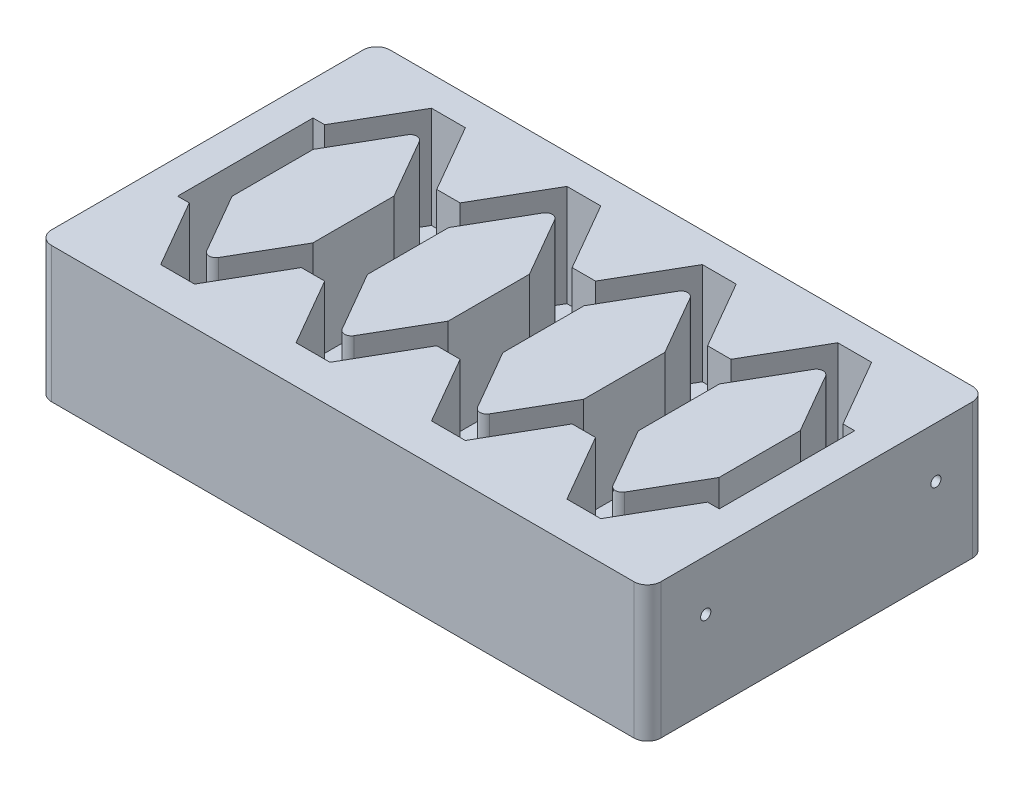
ISO-10303-21;
HEADER;
FILE_DESCRIPTION(('STEP AP214'),'2;1');
FILE_NAME('part.step','',(''),(''),'','','');
FILE_SCHEMA(('AUTOMOTIVE_DESIGN { 1 0 10303 214 1 1 1 1 }'));
ENDSEC;
DATA;
#1=APPLICATION_CONTEXT('core data for automotive mechanical design processes');
#2=APPLICATION_PROTOCOL_DEFINITION('international standard','automotive_design',2000,#1);
#3=PRODUCT_CONTEXT('',#1,'mechanical');
#4=PRODUCT('Part','Part','',(#3));
#5=PRODUCT_RELATED_PRODUCT_CATEGORY('part','',(#4));
#6=PRODUCT_DEFINITION_FORMATION('','',#4);
#7=PRODUCT_DEFINITION_CONTEXT('part definition',#1,'design');
#8=PRODUCT_DEFINITION('design','',#6,#7);
#9=PRODUCT_DEFINITION_SHAPE('','',#8);
#10=(LENGTH_UNIT() NAMED_UNIT(*) SI_UNIT(.MILLI.,.METRE.));
#11=(NAMED_UNIT(*) PLANE_ANGLE_UNIT() SI_UNIT($,.RADIAN.));
#12=(NAMED_UNIT(*) SI_UNIT($,.STERADIAN.) SOLID_ANGLE_UNIT());
#13=UNCERTAINTY_MEASURE_WITH_UNIT(LENGTH_MEASURE(1.E-05),#10,'distance_accuracy_value','');
#14=(GEOMETRIC_REPRESENTATION_CONTEXT(3) GLOBAL_UNCERTAINTY_ASSIGNED_CONTEXT((#13)) GLOBAL_UNIT_ASSIGNED_CONTEXT((#10,
#11,#12)) REPRESENTATION_CONTEXT('',''));
#15=CARTESIAN_POINT('',(0.,0.,0.));
#16=DIRECTION('',(0.,0.,1.));
#17=DIRECTION('',(1.,0.,0.));
#18=AXIS2_PLACEMENT_3D('',#15,#16,#17);
#19=CARTESIAN_POINT('',(0.,20.,0.));
#20=DIRECTION('',(0.,1.,0.));
#21=DIRECTION('',(0.,0.,1.));
#22=AXIS2_PLACEMENT_3D('',#19,#20,#21);
#23=PLANE('',#22);
#24=DIRECTION('',(-0.499999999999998,0.,-0.86602540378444));
#25=VECTOR('',#24,1.);
#26=CARTESIAN_POINT('',(57.5,20.,-20.));
#27=LINE('',#26,#25);
#28=CARTESIAN_POINT('',(63.2735026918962,20.,-10.));
#29=VERTEX_POINT('',#28);
#30=CARTESIAN_POINT('',(57.5,20.,-20.));
#31=VERTEX_POINT('',#30);
#32=EDGE_CURVE('E736',#29,#31,#27,.T.);
#33=ORIENTED_EDGE('',*,*,#32,.F.);
#34=DIRECTION('',(-1.,0.,0.));
#35=VECTOR('',#34,1.);
#36=CARTESIAN_POINT('',(63.2735026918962,20.,-10.));
#37=LINE('',#36,#35);
#38=CARTESIAN_POINT('',(66.7264973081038,20.,-10.));
#39=VERTEX_POINT('',#38);
#40=EDGE_CURVE('E734',#39,#29,#37,.T.);
#41=ORIENTED_EDGE('',*,*,#40,.F.);
#42=DIRECTION('',(-0.499999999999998,0.,0.86602540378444));
#43=VECTOR('',#42,1.);
#44=CARTESIAN_POINT('',(66.7264973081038,20.,-10.));
#45=LINE('',#44,#43);
#46=CARTESIAN_POINT('',(72.5,20.,-20.));
#47=VERTEX_POINT('',#46);
#48=EDGE_CURVE('E609',#47,#39,#45,.T.);
#49=ORIENTED_EDGE('',*,*,#48,.F.);
#50=DIRECTION('',(-1.,0.,0.));
#51=VECTOR('',#50,1.);
#52=CARTESIAN_POINT('',(72.5,20.,-20.));
#53=LINE('',#52,#51);
#54=CARTESIAN_POINT('',(77.5,20.,-20.));
#55=VERTEX_POINT('',#54);
#56=EDGE_CURVE('E606',#55,#47,#53,.T.);
#57=ORIENTED_EDGE('',*,*,#56,.F.);
#58=DIRECTION('',(-0.499999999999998,0.,-0.86602540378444));
#59=VECTOR('',#58,1.);
#60=CARTESIAN_POINT('',(77.5,20.,-20.));
#61=LINE('',#60,#59);
#62=CARTESIAN_POINT('',(83.2735026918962,20.,-10.));
#63=VERTEX_POINT('',#62);
#64=EDGE_CURVE('E604',#63,#55,#61,.T.);
#65=ORIENTED_EDGE('',*,*,#64,.F.);
#66=DIRECTION('',(-1.,0.,0.));
#67=VECTOR('',#66,1.);
#68=CARTESIAN_POINT('',(83.2735026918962,20.,-10.));
#69=LINE('',#68,#67);
#70=CARTESIAN_POINT('',(85.,20.,-10.));
#71=VERTEX_POINT('',#70);
#72=EDGE_CURVE('E602',#71,#63,#69,.T.);
#73=ORIENTED_EDGE('',*,*,#72,.F.);
#74=DIRECTION('',(0.,0.,-1.));
#75=VECTOR('',#74,1.);
#76=CARTESIAN_POINT('',(85.,20.,-10.));
#77=LINE('',#76,#75);
#78=CARTESIAN_POINT('',(85.,20.,10.));
#79=VERTEX_POINT('',#78);
#80=EDGE_CURVE('E600',#79,#71,#77,.T.);
#81=ORIENTED_EDGE('',*,*,#80,.F.);
#82=DIRECTION('',(1.,0.,0.));
#83=VECTOR('',#82,1.);
#84=CARTESIAN_POINT('',(85.,20.,10.));
#85=LINE('',#84,#83);
#86=CARTESIAN_POINT('',(83.2735026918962,20.,10.));
#87=VERTEX_POINT('',#86);
#88=EDGE_CURVE('E598',#87,#79,#85,.T.);
#89=ORIENTED_EDGE('',*,*,#88,.F.);
#90=DIRECTION('',(0.499999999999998,0.,-0.86602540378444));
#91=VECTOR('',#90,1.);
#92=CARTESIAN_POINT('',(77.5,20.,20.));
#93=LINE('',#92,#91);
#94=CARTESIAN_POINT('',(77.5,20.,20.));
#95=VERTEX_POINT('',#94);
#96=EDGE_CURVE('E596',#95,#87,#93,.T.);
#97=ORIENTED_EDGE('',*,*,#96,.F.);
#98=DIRECTION('',(1.,0.,0.));
#99=VECTOR('',#98,1.);
#100=CARTESIAN_POINT('',(72.5,20.,20.));
#101=LINE('',#100,#99);
#102=CARTESIAN_POINT('',(72.5,20.,20.));
#103=VERTEX_POINT('',#102);
#104=EDGE_CURVE('E593',#103,#95,#101,.T.);
#105=ORIENTED_EDGE('',*,*,#104,.F.);
#106=DIRECTION('',(0.499999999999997,0.,0.86602540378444));
#107=VECTOR('',#106,1.);
#108=CARTESIAN_POINT('',(66.7264973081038,20.,10.));
#109=LINE('',#108,#107);
#110=CARTESIAN_POINT('',(66.7264973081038,20.,10.));
#111=VERTEX_POINT('',#110);
#112=EDGE_CURVE('E591',#111,#103,#109,.T.);
#113=ORIENTED_EDGE('',*,*,#112,.F.);
#114=DIRECTION('',(1.,0.,0.));
#115=VECTOR('',#114,1.);
#116=CARTESIAN_POINT('',(65.,20.,10.));
#117=LINE('',#116,#115);
#118=CARTESIAN_POINT('',(63.2735026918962,20.,10.));
#119=VERTEX_POINT('',#118);
#120=EDGE_CURVE('E732',#119,#111,#117,.T.);
#121=ORIENTED_EDGE('',*,*,#120,.F.);
#122=DIRECTION('',(0.499999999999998,0.,-0.86602540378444));
#123=VECTOR('',#122,1.);
#124=CARTESIAN_POINT('',(57.5,20.,20.));
#125=LINE('',#124,#123);
#126=CARTESIAN_POINT('',(57.5,20.,20.));
#127=VERTEX_POINT('',#126);
#128=EDGE_CURVE('E730',#127,#119,#125,.T.);
#129=ORIENTED_EDGE('',*,*,#128,.F.);
#130=DIRECTION('',(1.,0.,0.));
#131=VECTOR('',#130,1.);
#132=CARTESIAN_POINT('',(52.5,20.,20.));
#133=LINE('',#132,#131);
#134=CARTESIAN_POINT('',(52.5,20.,20.));
#135=VERTEX_POINT('',#134);
#136=EDGE_CURVE('E727',#135,#127,#133,.T.);
#137=ORIENTED_EDGE('',*,*,#136,.F.);
#138=DIRECTION('',(0.499999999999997,0.,0.86602540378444));
#139=VECTOR('',#138,1.);
#140=CARTESIAN_POINT('',(46.7264973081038,20.,10.));
#141=LINE('',#140,#139);
#142=CARTESIAN_POINT('',(46.7264973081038,20.,10.));
#143=VERTEX_POINT('',#142);
#144=EDGE_CURVE('E725',#143,#135,#141,.T.);
#145=ORIENTED_EDGE('',*,*,#144,.F.);
#146=DIRECTION('',(1.,0.,0.));
#147=VECTOR('',#146,1.);
#148=CARTESIAN_POINT('',(45.,20.,10.));
#149=LINE('',#148,#147);
#150=CARTESIAN_POINT('',(43.2735026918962,20.,10.));
#151=VERTEX_POINT('',#150);
#152=EDGE_CURVE('E855',#151,#143,#149,.T.);
#153=ORIENTED_EDGE('',*,*,#152,.F.);
#154=DIRECTION('',(0.499999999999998,0.,-0.86602540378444));
#155=VECTOR('',#154,1.);
#156=CARTESIAN_POINT('',(37.5,20.,20.));
#157=LINE('',#156,#155);
#158=CARTESIAN_POINT('',(37.5,20.,20.));
#159=VERTEX_POINT('',#158);
#160=EDGE_CURVE('E853',#159,#151,#157,.T.);
#161=ORIENTED_EDGE('',*,*,#160,.F.);
#162=DIRECTION('',(1.,0.,0.));
#163=VECTOR('',#162,1.);
#164=CARTESIAN_POINT('',(32.5,20.,20.));
#165=LINE('',#164,#163);
#166=CARTESIAN_POINT('',(32.5,20.,20.));
#167=VERTEX_POINT('',#166);
#168=EDGE_CURVE('E850',#167,#159,#165,.T.);
#169=ORIENTED_EDGE('',*,*,#168,.F.);
#170=DIRECTION('',(0.499999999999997,0.,0.86602540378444));
#171=VECTOR('',#170,1.);
#172=CARTESIAN_POINT('',(26.7264973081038,20.,10.));
#173=LINE('',#172,#171);
#174=CARTESIAN_POINT('',(26.7264973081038,20.,10.));
#175=VERTEX_POINT('',#174);
#176=EDGE_CURVE('E848',#175,#167,#173,.T.);
#177=ORIENTED_EDGE('',*,*,#176,.F.);
#178=DIRECTION('',(1.,0.,0.));
#179=VECTOR('',#178,1.);
#180=CARTESIAN_POINT('',(25.,20.,10.));
#181=LINE('',#180,#179);
#182=CARTESIAN_POINT('',(23.2735026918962,20.,10.));
#183=VERTEX_POINT('',#182);
#184=EDGE_CURVE('E982',#183,#175,#181,.T.);
#185=ORIENTED_EDGE('',*,*,#184,.F.);
#186=DIRECTION('',(0.499999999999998,0.,-0.86602540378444));
#187=VECTOR('',#186,1.);
#188=CARTESIAN_POINT('',(17.5,20.,20.));
#189=LINE('',#188,#187);
#190=CARTESIAN_POINT('',(17.5,20.,20.));
#191=VERTEX_POINT('',#190);
#192=EDGE_CURVE('E980',#191,#183,#189,.T.);
#193=ORIENTED_EDGE('',*,*,#192,.F.);
#194=DIRECTION('',(1.,0.,0.));
#195=VECTOR('',#194,1.);
#196=CARTESIAN_POINT('',(12.5,20.,20.));
#197=LINE('',#196,#195);
#198=CARTESIAN_POINT('',(12.5,20.,20.));
#199=VERTEX_POINT('',#198);
#200=EDGE_CURVE('E978',#199,#191,#197,.T.);
#201=ORIENTED_EDGE('',*,*,#200,.F.);
#202=DIRECTION('',(0.499999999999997,0.,0.86602540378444));
#203=VECTOR('',#202,1.);
#204=CARTESIAN_POINT('',(6.72649730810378,20.,10.));
#205=LINE('',#204,#203);
#206=CARTESIAN_POINT('',(6.72649730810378,20.,10.));
#207=VERTEX_POINT('',#206);
#208=EDGE_CURVE('E976',#207,#199,#205,.T.);
#209=ORIENTED_EDGE('',*,*,#208,.F.);
#210=DIRECTION('',(1.,0.,0.));
#211=VECTOR('',#210,1.);
#212=CARTESIAN_POINT('',(5.,20.,10.));
#213=LINE('',#212,#211);
#214=CARTESIAN_POINT('',(5.,20.,10.));
#215=VERTEX_POINT('',#214);
#216=EDGE_CURVE('E973',#215,#207,#213,.T.);
#217=ORIENTED_EDGE('',*,*,#216,.F.);
#218=DIRECTION('',(0.,0.,1.));
#219=VECTOR('',#218,1.);
#220=CARTESIAN_POINT('',(5.,20.,-10.));
#221=LINE('',#220,#219);
#222=CARTESIAN_POINT('',(5.,20.,-10.));
#223=VERTEX_POINT('',#222);
#224=EDGE_CURVE('E971',#223,#215,#221,.T.);
#225=ORIENTED_EDGE('',*,*,#224,.F.);
#226=DIRECTION('',(-1.,0.,0.));
#227=VECTOR('',#226,1.);
#228=CARTESIAN_POINT('',(5.,20.,-10.));
#229=LINE('',#228,#227);
#230=CARTESIAN_POINT('',(6.72649730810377,20.,-10.));
#231=VERTEX_POINT('',#230);
#232=EDGE_CURVE('E992',#231,#223,#229,.T.);
#233=ORIENTED_EDGE('',*,*,#232,.F.);
#234=DIRECTION('',(-0.499999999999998,0.,0.86602540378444));
#235=VECTOR('',#234,1.);
#236=CARTESIAN_POINT('',(6.72649730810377,20.,-10.));
#237=LINE('',#236,#235);
#238=CARTESIAN_POINT('',(12.5,20.,-20.));
#239=VERTEX_POINT('',#238);
#240=EDGE_CURVE('E990',#239,#231,#237,.T.);
#241=ORIENTED_EDGE('',*,*,#240,.F.);
#242=DIRECTION('',(-1.,0.,0.));
#243=VECTOR('',#242,1.);
#244=CARTESIAN_POINT('',(12.5,20.,-20.));
#245=LINE('',#244,#243);
#246=CARTESIAN_POINT('',(17.5,20.,-20.));
#247=VERTEX_POINT('',#246);
#248=EDGE_CURVE('E988',#247,#239,#245,.T.);
#249=ORIENTED_EDGE('',*,*,#248,.F.);
#250=DIRECTION('',(-0.499999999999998,0.,-0.86602540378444));
#251=VECTOR('',#250,1.);
#252=CARTESIAN_POINT('',(17.5,20.,-20.));
#253=LINE('',#252,#251);
#254=CARTESIAN_POINT('',(23.2735026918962,20.,-10.));
#255=VERTEX_POINT('',#254);
#256=EDGE_CURVE('E986',#255,#247,#253,.T.);
#257=ORIENTED_EDGE('',*,*,#256,.F.);
#258=DIRECTION('',(-1.,0.,0.));
#259=VECTOR('',#258,1.);
#260=CARTESIAN_POINT('',(23.2735026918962,20.,-10.));
#261=LINE('',#260,#259);
#262=CARTESIAN_POINT('',(26.7264973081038,20.,-10.));
#263=VERTEX_POINT('',#262);
#264=EDGE_CURVE('E984',#263,#255,#261,.T.);
#265=ORIENTED_EDGE('',*,*,#264,.F.);
#266=DIRECTION('',(-0.499999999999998,0.,0.86602540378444));
#267=VECTOR('',#266,1.);
#268=CARTESIAN_POINT('',(26.7264973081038,20.,-10.));
#269=LINE('',#268,#267);
#270=CARTESIAN_POINT('',(32.5,20.,-20.));
#271=VERTEX_POINT('',#270);
#272=EDGE_CURVE('E863',#271,#263,#269,.T.);
#273=ORIENTED_EDGE('',*,*,#272,.F.);
#274=DIRECTION('',(-1.,0.,0.));
#275=VECTOR('',#274,1.);
#276=CARTESIAN_POINT('',(32.5,20.,-20.));
#277=LINE('',#276,#275);
#278=CARTESIAN_POINT('',(37.5,20.,-20.));
#279=VERTEX_POINT('',#278);
#280=EDGE_CURVE('E861',#279,#271,#277,.T.);
#281=ORIENTED_EDGE('',*,*,#280,.F.);
#282=DIRECTION('',(-0.499999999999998,0.,-0.86602540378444));
#283=VECTOR('',#282,1.);
#284=CARTESIAN_POINT('',(37.5,20.,-20.));
#285=LINE('',#284,#283);
#286=CARTESIAN_POINT('',(43.2735026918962,20.,-10.));
#287=VERTEX_POINT('',#286);
#288=EDGE_CURVE('E859',#287,#279,#285,.T.);
#289=ORIENTED_EDGE('',*,*,#288,.F.);
#290=DIRECTION('',(-1.,0.,0.));
#291=VECTOR('',#290,1.);
#292=CARTESIAN_POINT('',(43.2735026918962,20.,-10.));
#293=LINE('',#292,#291);
#294=CARTESIAN_POINT('',(46.7264973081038,20.,-10.));
#295=VERTEX_POINT('',#294);
#296=EDGE_CURVE('E857',#295,#287,#293,.T.);
#297=ORIENTED_EDGE('',*,*,#296,.F.);
#298=DIRECTION('',(-0.499999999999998,0.,0.86602540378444));
#299=VECTOR('',#298,1.);
#300=CARTESIAN_POINT('',(46.7264973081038,20.,-10.));
#301=LINE('',#300,#299);
#302=CARTESIAN_POINT('',(52.5,20.,-20.));
#303=VERTEX_POINT('',#302);
#304=EDGE_CURVE('E740',#303,#295,#301,.T.);
#305=ORIENTED_EDGE('',*,*,#304,.F.);
#306=DIRECTION('',(-1.,0.,0.));
#307=VECTOR('',#306,1.);
#308=CARTESIAN_POINT('',(52.5,20.,-20.));
#309=LINE('',#308,#307);
#310=EDGE_CURVE('E738',#31,#303,#309,.T.);
#311=ORIENTED_EDGE('',*,*,#310,.F.);
#312=EDGE_LOOP('',(#33,#41,#49,#57,#65,#73,#81,#89,#97,#105,#113,#121,#129,#137,#145,#153,#161,
#169,#177,#185,#193,#201,#209,#217,#225,#233,#241,#249,#257,#265,#273,#281,#289,#297,#305,#311));
#313=FACE_BOUND('',#312,.T.);
#314=DIRECTION('',(-1.,0.,0.));
#315=VECTOR('',#314,1.);
#316=CARTESIAN_POINT('',(0.,20.,-24.3879472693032));
#317=LINE('',#316,#315);
#318=CARTESIAN_POINT('',(88.,20.,-24.3879472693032));
#319=VERTEX_POINT('',#318);
#320=CARTESIAN_POINT('',(1.99999999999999,20.,-24.3879472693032));
#321=VERTEX_POINT('',#320);
#322=EDGE_CURVE('E1102',#319,#321,#317,.T.);
#323=ORIENTED_EDGE('',*,*,#322,.T.);
#324=CARTESIAN_POINT('',(1.99999999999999,20.,-22.3879472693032));
#325=DIRECTION('',(0.,1.,0.));
#326=DIRECTION('',(0.,0.,1.));
#327=AXIS2_PLACEMENT_3D('',#324,#325,#326);
#328=CIRCLE('',#327,2.);
#329=CARTESIAN_POINT('',(0.,20.,-22.3879472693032));
#330=VERTEX_POINT('',#329);
#331=EDGE_CURVE('E1152',#321,#330,#328,.T.);
#332=ORIENTED_EDGE('',*,*,#331,.T.);
#333=DIRECTION('',(0.,0.,1.));
#334=VECTOR('',#333,1.);
#335=CARTESIAN_POINT('',(0.,20.,-24.3879472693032));
#336=LINE('',#335,#334);
#337=CARTESIAN_POINT('',(0.,20.,23.6120527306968));
#338=VERTEX_POINT('',#337);
#339=EDGE_CURVE('E1094',#330,#338,#336,.T.);
#340=ORIENTED_EDGE('',*,*,#339,.T.);
#341=CARTESIAN_POINT('',(2.,20.,23.6120527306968));
#342=DIRECTION('',(0.,1.,0.));
#343=DIRECTION('',(0.,0.,1.));
#344=AXIS2_PLACEMENT_3D('',#341,#342,#343);
#345=CIRCLE('',#344,2.);
#346=CARTESIAN_POINT('',(2.,20.,25.6120527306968));
#347=VERTEX_POINT('',#346);
#348=EDGE_CURVE('E1147',#338,#347,#345,.T.);
#349=ORIENTED_EDGE('',*,*,#348,.T.);
#350=DIRECTION('',(1.,0.,0.));
#351=VECTOR('',#350,1.);
#352=CARTESIAN_POINT('',(0.,20.,25.6120527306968));
#353=LINE('',#352,#351);
#354=CARTESIAN_POINT('',(88.,20.,25.6120527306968));
#355=VERTEX_POINT('',#354);
#356=EDGE_CURVE('E1097',#347,#355,#353,.T.);
#357=ORIENTED_EDGE('',*,*,#356,.T.);
#358=CARTESIAN_POINT('',(88.,20.,23.6120527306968));
#359=DIRECTION('',(0.,1.,0.));
#360=DIRECTION('',(0.,0.,1.));
#361=AXIS2_PLACEMENT_3D('',#358,#359,#360);
#362=CIRCLE('',#361,2.);
#363=CARTESIAN_POINT('',(90.,20.,23.6120527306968));
#364=VERTEX_POINT('',#363);
#365=EDGE_CURVE('E61',#355,#364,#362,.T.);
#366=ORIENTED_EDGE('',*,*,#365,.T.);
#367=DIRECTION('',(0.,0.,-1.));
#368=VECTOR('',#367,1.);
#369=CARTESIAN_POINT('',(90.,20.,-24.3879472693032));
#370=LINE('',#369,#368);
#371=CARTESIAN_POINT('',(90.,20.,-22.3879472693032));
#372=VERTEX_POINT('',#371);
#373=EDGE_CURVE('E1100',#364,#372,#370,.T.);
#374=ORIENTED_EDGE('',*,*,#373,.T.);
#375=CARTESIAN_POINT('',(88.,20.,-22.3879472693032));
#376=DIRECTION('',(0.,1.,0.));
#377=DIRECTION('',(0.,0.,1.));
#378=AXIS2_PLACEMENT_3D('',#375,#376,#377);
#379=CIRCLE('',#378,2.);
#380=EDGE_CURVE('E1150',#372,#319,#379,.T.);
#381=ORIENTED_EDGE('',*,*,#380,.T.);
#382=EDGE_LOOP('',(#323,#332,#340,#349,#357,#366,#374,#381));
#383=FACE_BOUND('',#382,.T.);
#384=ADVANCED_FACE('F39',(#313,#383),#23,.T.);
#385=CARTESIAN_POINT('',(0.,20.,-24.3879472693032));
#386=DIRECTION('',(1.,0.,0.));
#387=DIRECTION('',(0.,0.,-1.));
#388=AXIS2_PLACEMENT_3D('',#385,#386,#387);
#389=PLANE('',#388);
#390=CARTESIAN_POINT('',(0.,12.5,-17.));
#391=DIRECTION('',(1.,0.,0.));
#392=DIRECTION('',(0.,0.,-1.));
#393=AXIS2_PLACEMENT_3D('',#390,#391,#392);
#394=CIRCLE('',#393,0.75);
#395=CARTESIAN_POINT('',(0.,12.5,-17.75));
#396=VERTEX_POINT('',#395);
#397=EDGE_CURVE('E1110',#396,#396,#394,.F.);
#398=ORIENTED_EDGE('',*,*,#397,.F.);
#399=EDGE_LOOP('',(#398));
#400=FACE_BOUND('',#399,.T.);
#401=CARTESIAN_POINT('',(0.,12.5,17.));
#402=DIRECTION('',(1.,0.,0.));
#403=DIRECTION('',(0.,0.,-1.));
#404=AXIS2_PLACEMENT_3D('',#401,#402,#403);
#405=CIRCLE('',#404,0.75);
#406=CARTESIAN_POINT('',(0.,12.5,16.25));
#407=VERTEX_POINT('',#406);
#408=EDGE_CURVE('E1125',#407,#407,#405,.F.);
#409=ORIENTED_EDGE('',*,*,#408,.F.);
#410=EDGE_LOOP('',(#409));
#411=FACE_BOUND('',#410,.T.);
#412=CARTESIAN_POINT('',(0.,12.5,0.));
#413=DIRECTION('',(1.,0.,0.));
#414=DIRECTION('',(0.,0.,-1.));
#415=AXIS2_PLACEMENT_3D('',#412,#413,#414);
#416=CIRCLE('',#415,1.5);
#417=CARTESIAN_POINT('',(0.,12.5,-1.5));
#418=VERTEX_POINT('',#417);
#419=EDGE_CURVE('E1122',#418,#418,#416,.F.);
#420=ORIENTED_EDGE('',*,*,#419,.F.);
#421=EDGE_LOOP('',(#420));
#422=FACE_BOUND('',#421,.T.);
#423=ORIENTED_EDGE('',*,*,#339,.F.);
#424=DIRECTION('',(0.,-1.,0.));
#425=VECTOR('',#424,1.);
#426=CARTESIAN_POINT('',(0.,20.,-22.3879472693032));
#427=LINE('',#426,#425);
#428=CARTESIAN_POINT('',(0.,0.,-22.3879472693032));
#429=VERTEX_POINT('',#428);
#430=EDGE_CURVE('E1131',#330,#429,#427,.T.);
#431=ORIENTED_EDGE('',*,*,#430,.T.);
#432=DIRECTION('',(0.,0.,1.));
#433=VECTOR('',#432,1.);
#434=CARTESIAN_POINT('',(0.,0.,-24.3879472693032));
#435=LINE('',#434,#433);
#436=CARTESIAN_POINT('',(0.,0.,23.6120527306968));
#437=VERTEX_POINT('',#436);
#438=EDGE_CURVE('E1106',#429,#437,#435,.T.);
#439=ORIENTED_EDGE('',*,*,#438,.T.);
#440=DIRECTION('',(0.,-1.,0.));
#441=VECTOR('',#440,1.);
#442=CARTESIAN_POINT('',(0.,20.,23.6120527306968));
#443=LINE('',#442,#441);
#444=EDGE_CURVE('E1105',#437,#338,#443,.F.);
#445=ORIENTED_EDGE('',*,*,#444,.T.);
#446=EDGE_LOOP('',(#423,#431,#439,#445));
#447=FACE_BOUND('',#446,.T.);
#448=ADVANCED_FACE('F1189',(#400,#411,#422,#447),#389,.F.);
#449=CARTESIAN_POINT('',(0.,20.,25.6120527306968));
#450=DIRECTION('',(0.,0.,-1.));
#451=DIRECTION('',(-1.,0.,0.));
#452=AXIS2_PLACEMENT_3D('',#449,#450,#451);
#453=PLANE('',#452);
#454=DIRECTION('',(1.,0.,0.));
#455=VECTOR('',#454,1.);
#456=CARTESIAN_POINT('',(0.,0.,25.6120527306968));
#457=LINE('',#456,#455);
#458=CARTESIAN_POINT('',(2.,0.,25.6120527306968));
#459=VERTEX_POINT('',#458);
#460=CARTESIAN_POINT('',(88.,0.,25.6120527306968));
#461=VERTEX_POINT('',#460);
#462=EDGE_CURVE('E1109',#459,#461,#457,.T.);
#463=ORIENTED_EDGE('',*,*,#462,.T.);
#464=DIRECTION('',(0.,-1.,0.));
#465=VECTOR('',#464,1.);
#466=CARTESIAN_POINT('',(88.,20.,25.6120527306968));
#467=LINE('',#466,#465);
#468=EDGE_CURVE('E11',#461,#355,#467,.F.);
#469=ORIENTED_EDGE('',*,*,#468,.T.);
#470=ORIENTED_EDGE('',*,*,#356,.F.);
#471=DIRECTION('',(0.,-1.,0.));
#472=VECTOR('',#471,1.);
#473=CARTESIAN_POINT('',(2.,20.,25.6120527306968));
#474=LINE('',#473,#472);
#475=EDGE_CURVE('E47',#347,#459,#474,.T.);
#476=ORIENTED_EDGE('',*,*,#475,.T.);
#477=EDGE_LOOP('',(#463,#469,#470,#476));
#478=FACE_BOUND('',#477,.T.);
#479=ADVANCED_FACE('F1162',(#478),#453,.F.);
#480=CARTESIAN_POINT('',(90.,20.,-24.3879472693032));
#481=DIRECTION('',(-1.,0.,0.));
#482=DIRECTION('',(0.,0.,1.));
#483=AXIS2_PLACEMENT_3D('',#480,#481,#482);
#484=PLANE('',#483);
#485=CARTESIAN_POINT('',(90.,12.5,17.));
#486=DIRECTION('',(-1.,0.,0.));
#487=DIRECTION('',(0.,0.,1.));
#488=AXIS2_PLACEMENT_3D('',#485,#486,#487);
#489=CIRCLE('',#488,0.75);
#490=CARTESIAN_POINT('',(90.,12.5,17.75));
#491=VERTEX_POINT('',#490);
#492=EDGE_CURVE('E1119',#491,#491,#489,.F.);
#493=ORIENTED_EDGE('',*,*,#492,.F.);
#494=EDGE_LOOP('',(#493));
#495=FACE_BOUND('',#494,.T.);
#496=CARTESIAN_POINT('',(90.,12.5,-17.));
#497=DIRECTION('',(-1.,0.,0.));
#498=DIRECTION('',(0.,0.,1.));
#499=AXIS2_PLACEMENT_3D('',#496,#497,#498);
#500=CIRCLE('',#499,0.75);
#501=CARTESIAN_POINT('',(90.,12.5,-16.25));
#502=VERTEX_POINT('',#501);
#503=EDGE_CURVE('E1093',#502,#502,#500,.F.);
#504=ORIENTED_EDGE('',*,*,#503,.F.);
#505=EDGE_LOOP('',(#504));
#506=FACE_BOUND('',#505,.T.);
#507=DIRECTION('',(0.,0.,-1.));
#508=VECTOR('',#507,1.);
#509=CARTESIAN_POINT('',(90.,0.,-24.3879472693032));
#510=LINE('',#509,#508);
#511=CARTESIAN_POINT('',(90.,0.,23.6120527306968));
#512=VERTEX_POINT('',#511);
#513=CARTESIAN_POINT('',(90.,0.,-22.3879472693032));
#514=VERTEX_POINT('',#513);
#515=EDGE_CURVE('E1113',#512,#514,#510,.T.);
#516=ORIENTED_EDGE('',*,*,#515,.T.);
#517=DIRECTION('',(0.,-1.,0.));
#518=VECTOR('',#517,1.);
#519=CARTESIAN_POINT('',(90.,20.,-22.3879472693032));
#520=LINE('',#519,#518);
#521=EDGE_CURVE('E54',#514,#372,#520,.F.);
#522=ORIENTED_EDGE('',*,*,#521,.T.);
#523=ORIENTED_EDGE('',*,*,#373,.F.);
#524=DIRECTION('',(0.,-1.,0.));
#525=VECTOR('',#524,1.);
#526=CARTESIAN_POINT('',(90.,20.,23.6120527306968));
#527=LINE('',#526,#525);
#528=EDGE_CURVE('E1154',#364,#512,#527,.T.);
#529=ORIENTED_EDGE('',*,*,#528,.T.);
#530=EDGE_LOOP('',(#516,#522,#523,#529));
#531=FACE_BOUND('',#530,.T.);
#532=ADVANCED_FACE('F1173',(#495,#506,#531),#484,.F.);
#533=CARTESIAN_POINT('',(0.,20.,-24.3879472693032));
#534=DIRECTION('',(0.,0.,1.));
#535=DIRECTION('',(1.,0.,0.));
#536=AXIS2_PLACEMENT_3D('',#533,#534,#535);
#537=PLANE('',#536);
#538=DIRECTION('',(-1.,0.,0.));
#539=VECTOR('',#538,1.);
#540=CARTESIAN_POINT('',(0.,0.,-24.3879472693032));
#541=LINE('',#540,#539);
#542=CARTESIAN_POINT('',(88.,0.,-24.3879472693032));
#543=VERTEX_POINT('',#542);
#544=CARTESIAN_POINT('',(1.99999999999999,0.,-24.3879472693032));
#545=VERTEX_POINT('',#544);
#546=EDGE_CURVE('E1098',#543,#545,#541,.T.);
#547=ORIENTED_EDGE('',*,*,#546,.T.);
#548=DIRECTION('',(0.,-1.,0.));
#549=VECTOR('',#548,1.);
#550=CARTESIAN_POINT('',(1.99999999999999,20.,-24.3879472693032));
#551=LINE('',#550,#549);
#552=EDGE_CURVE('E1145',#545,#321,#551,.F.);
#553=ORIENTED_EDGE('',*,*,#552,.T.);
#554=ORIENTED_EDGE('',*,*,#322,.F.);
#555=DIRECTION('',(0.,-1.,0.));
#556=VECTOR('',#555,1.);
#557=CARTESIAN_POINT('',(88.,20.,-24.3879472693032));
#558=LINE('',#557,#556);
#559=EDGE_CURVE('E1142',#319,#543,#558,.T.);
#560=ORIENTED_EDGE('',*,*,#559,.T.);
#561=EDGE_LOOP('',(#547,#553,#554,#560));
#562=FACE_BOUND('',#561,.T.);
#563=ADVANCED_FACE('F1181',(#562),#537,.F.);
#564=CARTESIAN_POINT('',(0.,0.,0.));
#565=DIRECTION('',(0.,1.,0.));
#566=DIRECTION('',(0.,0.,1.));
#567=AXIS2_PLACEMENT_3D('',#564,#565,#566);
#568=PLANE('',#567);
#569=ORIENTED_EDGE('',*,*,#438,.F.);
#570=CARTESIAN_POINT('',(1.99999999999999,0.,-22.3879472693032));
#571=DIRECTION('',(0.,1.,0.));
#572=DIRECTION('',(0.,0.,1.));
#573=AXIS2_PLACEMENT_3D('',#570,#571,#572);
#574=CIRCLE('',#573,2.);
#575=EDGE_CURVE('E1140',#429,#545,#574,.F.);
#576=ORIENTED_EDGE('',*,*,#575,.T.);
#577=ORIENTED_EDGE('',*,*,#546,.F.);
#578=CARTESIAN_POINT('',(88.,0.,-22.3879472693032));
#579=DIRECTION('',(0.,1.,0.));
#580=DIRECTION('',(0.,0.,1.));
#581=AXIS2_PLACEMENT_3D('',#578,#579,#580);
#582=CIRCLE('',#581,2.);
#583=EDGE_CURVE('E1138',#543,#514,#582,.F.);
#584=ORIENTED_EDGE('',*,*,#583,.T.);
#585=ORIENTED_EDGE('',*,*,#515,.F.);
#586=CARTESIAN_POINT('',(88.,0.,23.6120527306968));
#587=DIRECTION('',(0.,1.,0.));
#588=DIRECTION('',(0.,0.,1.));
#589=AXIS2_PLACEMENT_3D('',#586,#587,#588);
#590=CIRCLE('',#589,2.);
#591=EDGE_CURVE('E1136',#512,#461,#590,.F.);
#592=ORIENTED_EDGE('',*,*,#591,.T.);
#593=ORIENTED_EDGE('',*,*,#462,.F.);
#594=CARTESIAN_POINT('',(2.,0.,23.6120527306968));
#595=DIRECTION('',(0.,1.,0.));
#596=DIRECTION('',(0.,0.,1.));
#597=AXIS2_PLACEMENT_3D('',#594,#595,#596);
#598=CIRCLE('',#597,2.);
#599=EDGE_CURVE('E1134',#459,#437,#598,.F.);
#600=ORIENTED_EDGE('',*,*,#599,.T.);
#601=EDGE_LOOP('',(#569,#576,#577,#584,#585,#592,#593,#600));
#602=FACE_BOUND('',#601,.T.);
#603=ADVANCED_FACE('F1168',(#602),#568,.F.);
#604=CARTESIAN_POINT('',(95.,12.5,-17.));
#605=DIRECTION('',(-1.,0.,0.));
#606=DIRECTION('',(0.,-0.0285526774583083,0.999592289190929));
#607=AXIS2_PLACEMENT_3D('',#604,#605,#606);
#608=CYLINDRICAL_SURFACE('',#607,0.75);
#609=CARTESIAN_POINT('',(10.7679491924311,12.5,-17.));
#610=DIRECTION('',(0.86602540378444,0.,0.499999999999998));
#611=DIRECTION('',(-0.499999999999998,0.,0.86602540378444));
#612=AXIS2_PLACEMENT_3D('',#609,#610,#611);
#613=ELLIPSE('',#612,0.866025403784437,0.75);
#614=CARTESIAN_POINT('',(10.3349364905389,12.5,-16.25));
#615=VERTEX_POINT('',#614);
#616=EDGE_CURVE('E1087',#615,#615,#613,.T.);
#617=ORIENTED_EDGE('',*,*,#616,.T.);
#618=EDGE_LOOP('',(#617));
#619=FACE_BOUND('',#618,.T.);
#620=ORIENTED_EDGE('',*,*,#397,.T.);
#621=EDGE_LOOP('',(#620));
#622=FACE_BOUND('',#621,.T.);
#623=ADVANCED_FACE('F1221',(#619,#622),#608,.F.);
#624=CARTESIAN_POINT('',(95.,12.5,17.));
#625=DIRECTION('',(-1.,0.,0.));
#626=DIRECTION('',(0.,-0.999256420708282,-0.0385565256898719));
#627=AXIS2_PLACEMENT_3D('',#624,#625,#626);
#628=CYLINDRICAL_SURFACE('',#627,0.75);
#629=CARTESIAN_POINT('',(10.7679491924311,12.5,17.));
#630=DIRECTION('',(0.86602540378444,0.,-0.499999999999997));
#631=DIRECTION('',(-0.499999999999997,0.,-0.86602540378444));
#632=AXIS2_PLACEMENT_3D('',#629,#630,#631);
#633=ELLIPSE('',#632,0.866025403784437,0.75);
#634=CARTESIAN_POINT('',(10.3349364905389,12.5,16.25));
#635=VERTEX_POINT('',#634);
#636=EDGE_CURVE('E1066',#635,#635,#633,.T.);
#637=ORIENTED_EDGE('',*,*,#636,.T.);
#638=EDGE_LOOP('',(#637));
#639=FACE_BOUND('',#638,.T.);
#640=ORIENTED_EDGE('',*,*,#408,.T.);
#641=EDGE_LOOP('',(#640));
#642=FACE_BOUND('',#641,.T.);
#643=ADVANCED_FACE('F1442',(#639,#642),#628,.F.);
#644=CARTESIAN_POINT('',(11.0358983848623,12.5,0.));
#645=DIRECTION('',(-1.,0.,0.));
#646=DIRECTION('',(0.,-0.477508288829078,0.878627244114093));
#647=AXIS2_PLACEMENT_3D('',#644,#645,#646);
#648=CYLINDRICAL_SURFACE('',#647,1.5);
#649=CARTESIAN_POINT('',(5.,12.5,0.));
#650=DIRECTION('',(-1.,0.,0.));
#651=DIRECTION('',(0.,0.,1.));
#652=AXIS2_PLACEMENT_3D('',#649,#650,#651);
#653=CIRCLE('',#652,1.5);
#654=CARTESIAN_POINT('',(5.,12.5,1.5));
#655=VERTEX_POINT('',#654);
#656=EDGE_CURVE('E545',#655,#655,#653,.T.);
#657=ORIENTED_EDGE('',*,*,#656,.F.);
#658=EDGE_LOOP('',(#657));
#659=FACE_BOUND('',#658,.T.);
#660=ORIENTED_EDGE('',*,*,#419,.T.);
#661=EDGE_LOOP('',(#660));
#662=FACE_BOUND('',#661,.T.);
#663=ADVANCED_FACE('F1444',(#659,#662),#648,.F.);
#664=CARTESIAN_POINT('',(79.2320508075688,12.5,17.));
#665=DIRECTION('',(-0.86602540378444,0.,-0.499999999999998));
#666=DIRECTION('',(-0.499999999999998,0.,0.86602540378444));
#667=AXIS2_PLACEMENT_3D('',#664,#665,#666);
#668=ELLIPSE('',#667,0.866025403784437,0.75);
#669=CARTESIAN_POINT('',(78.7990381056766,12.5,17.75));
#670=VERTEX_POINT('',#669);
#671=EDGE_CURVE('E1045',#670,#670,#668,.T.);
#672=ORIENTED_EDGE('',*,*,#671,.T.);
#673=EDGE_LOOP('',(#672));
#674=FACE_BOUND('',#673,.T.);
#675=ORIENTED_EDGE('',*,*,#492,.T.);
#676=EDGE_LOOP('',(#675));
#677=FACE_BOUND('',#676,.T.);
#678=ADVANCED_FACE('F1446',(#674,#677),#628,.F.);
#679=CARTESIAN_POINT('',(79.2320508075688,12.5,-17.));
#680=DIRECTION('',(-0.86602540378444,0.,0.499999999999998));
#681=DIRECTION('',(-0.499999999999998,0.,-0.86602540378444));
#682=AXIS2_PLACEMENT_3D('',#679,#680,#681);
#683=ELLIPSE('',#682,0.866025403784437,0.75);
#684=CARTESIAN_POINT('',(78.7990381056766,12.5,-17.75));
#685=VERTEX_POINT('',#684);
#686=EDGE_CURVE('E1072',#685,#685,#683,.T.);
#687=ORIENTED_EDGE('',*,*,#686,.T.);
#688=EDGE_LOOP('',(#687));
#689=FACE_BOUND('',#688,.T.);
#690=ORIENTED_EDGE('',*,*,#503,.T.);
#691=EDGE_LOOP('',(#690));
#692=FACE_BOUND('',#691,.T.);
#693=ADVANCED_FACE('F1398',(#689,#692),#608,.F.);
#694=CARTESIAN_POINT('',(5.,5.,0.));
#695=DIRECTION('',(0.,1.,0.));
#696=DIRECTION('',(0.,0.,1.));
#697=AXIS2_PLACEMENT_3D('',#694,#695,#696);
#698=PLANE('',#697);
#699=DIRECTION('',(0.,0.,1.));
#700=VECTOR('',#699,1.);
#701=CARTESIAN_POINT('',(5.,5.,-10.));
#702=LINE('',#701,#700);
#703=CARTESIAN_POINT('',(5.,5.,-10.));
#704=VERTEX_POINT('',#703);
#705=CARTESIAN_POINT('',(5.,5.,10.));
#706=VERTEX_POINT('',#705);
#707=EDGE_CURVE('E970',#704,#706,#702,.T.);
#708=ORIENTED_EDGE('',*,*,#707,.T.);
#709=DIRECTION('',(1.,0.,0.));
#710=VECTOR('',#709,1.);
#711=CARTESIAN_POINT('',(5.,5.,10.));
#712=LINE('',#711,#710);
#713=CARTESIAN_POINT('',(6.72649730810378,5.,10.));
#714=VERTEX_POINT('',#713);
#715=EDGE_CURVE('E997',#706,#714,#712,.T.);
#716=ORIENTED_EDGE('',*,*,#715,.T.);
#717=DIRECTION('',(0.499999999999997,0.,0.86602540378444));
#718=VECTOR('',#717,1.);
#719=CARTESIAN_POINT('',(6.72649730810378,5.,10.));
#720=LINE('',#719,#718);
#721=CARTESIAN_POINT('',(12.5,5.,20.));
#722=VERTEX_POINT('',#721);
#723=EDGE_CURVE('E999',#714,#722,#720,.T.);
#724=ORIENTED_EDGE('',*,*,#723,.T.);
#725=DIRECTION('',(1.,0.,0.));
#726=VECTOR('',#725,1.);
#727=CARTESIAN_POINT('',(12.5,5.,20.));
#728=LINE('',#727,#726);
#729=CARTESIAN_POINT('',(17.5,5.,20.));
#730=VERTEX_POINT('',#729);
#731=EDGE_CURVE('E1001',#722,#730,#728,.T.);
#732=ORIENTED_EDGE('',*,*,#731,.T.);
#733=DIRECTION('',(0.499999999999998,0.,-0.86602540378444));
#734=VECTOR('',#733,1.);
#735=CARTESIAN_POINT('',(17.5,5.,20.));
#736=LINE('',#735,#734);
#737=CARTESIAN_POINT('',(23.2735026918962,5.,10.));
#738=VERTEX_POINT('',#737);
#739=EDGE_CURVE('E1003',#730,#738,#736,.T.);
#740=ORIENTED_EDGE('',*,*,#739,.T.);
#741=DIRECTION('',(1.,0.,0.));
#742=VECTOR('',#741,1.);
#743=CARTESIAN_POINT('',(25.,5.,10.));
#744=LINE('',#743,#742);
#745=CARTESIAN_POINT('',(26.7264973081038,5.,10.));
#746=VERTEX_POINT('',#745);
#747=EDGE_CURVE('E1005',#738,#746,#744,.T.);
#748=ORIENTED_EDGE('',*,*,#747,.T.);
#749=DIRECTION('',(0.499999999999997,0.,0.86602540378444));
#750=VECTOR('',#749,1.);
#751=CARTESIAN_POINT('',(26.7264973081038,5.,10.));
#752=LINE('',#751,#750);
#753=CARTESIAN_POINT('',(32.5,5.,20.));
#754=VERTEX_POINT('',#753);
#755=EDGE_CURVE('E847',#746,#754,#752,.T.);
#756=ORIENTED_EDGE('',*,*,#755,.T.);
#757=DIRECTION('',(1.,0.,0.));
#758=VECTOR('',#757,1.);
#759=CARTESIAN_POINT('',(32.5,5.,20.));
#760=LINE('',#759,#758);
#761=CARTESIAN_POINT('',(37.5,5.,20.));
#762=VERTEX_POINT('',#761);
#763=EDGE_CURVE('E867',#754,#762,#760,.T.);
#764=ORIENTED_EDGE('',*,*,#763,.T.);
#765=DIRECTION('',(0.499999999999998,0.,-0.86602540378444));
#766=VECTOR('',#765,1.);
#767=CARTESIAN_POINT('',(37.5,5.,20.));
#768=LINE('',#767,#766);
#769=CARTESIAN_POINT('',(43.2735026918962,5.,10.));
#770=VERTEX_POINT('',#769);
#771=EDGE_CURVE('E869',#762,#770,#768,.T.);
#772=ORIENTED_EDGE('',*,*,#771,.T.);
#773=DIRECTION('',(1.,0.,0.));
#774=VECTOR('',#773,1.);
#775=CARTESIAN_POINT('',(45.,5.,10.));
#776=LINE('',#775,#774);
#777=CARTESIAN_POINT('',(46.7264973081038,5.,10.));
#778=VERTEX_POINT('',#777);
#779=EDGE_CURVE('E871',#770,#778,#776,.T.);
#780=ORIENTED_EDGE('',*,*,#779,.T.);
#781=DIRECTION('',(0.499999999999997,0.,0.86602540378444));
#782=VECTOR('',#781,1.);
#783=CARTESIAN_POINT('',(46.7264973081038,5.,10.));
#784=LINE('',#783,#782);
#785=CARTESIAN_POINT('',(52.5,5.,20.));
#786=VERTEX_POINT('',#785);
#787=EDGE_CURVE('E724',#778,#786,#784,.T.);
#788=ORIENTED_EDGE('',*,*,#787,.T.);
#789=DIRECTION('',(1.,0.,0.));
#790=VECTOR('',#789,1.);
#791=CARTESIAN_POINT('',(52.5,5.,20.));
#792=LINE('',#791,#790);
#793=CARTESIAN_POINT('',(57.5,5.,20.));
#794=VERTEX_POINT('',#793);
#795=EDGE_CURVE('E744',#786,#794,#792,.T.);
#796=ORIENTED_EDGE('',*,*,#795,.T.);
#797=DIRECTION('',(0.499999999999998,0.,-0.86602540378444));
#798=VECTOR('',#797,1.);
#799=CARTESIAN_POINT('',(57.5,5.,20.));
#800=LINE('',#799,#798);
#801=CARTESIAN_POINT('',(63.2735026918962,5.,10.));
#802=VERTEX_POINT('',#801);
#803=EDGE_CURVE('E746',#794,#802,#800,.T.);
#804=ORIENTED_EDGE('',*,*,#803,.T.);
#805=DIRECTION('',(1.,0.,0.));
#806=VECTOR('',#805,1.);
#807=CARTESIAN_POINT('',(65.,5.,10.));
#808=LINE('',#807,#806);
#809=CARTESIAN_POINT('',(66.7264973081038,5.,10.));
#810=VERTEX_POINT('',#809);
#811=EDGE_CURVE('E748',#802,#810,#808,.T.);
#812=ORIENTED_EDGE('',*,*,#811,.T.);
#813=DIRECTION('',(0.499999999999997,0.,0.86602540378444));
#814=VECTOR('',#813,1.);
#815=CARTESIAN_POINT('',(66.7264973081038,5.,10.));
#816=LINE('',#815,#814);
#817=CARTESIAN_POINT('',(72.5,5.,20.));
#818=VERTEX_POINT('',#817);
#819=EDGE_CURVE('E523',#810,#818,#816,.T.);
#820=ORIENTED_EDGE('',*,*,#819,.T.);
#821=DIRECTION('',(1.,0.,0.));
#822=VECTOR('',#821,1.);
#823=CARTESIAN_POINT('',(72.5,5.,20.));
#824=LINE('',#823,#822);
#825=CARTESIAN_POINT('',(77.5,5.,20.));
#826=VERTEX_POINT('',#825);
#827=EDGE_CURVE('E613',#818,#826,#824,.T.);
#828=ORIENTED_EDGE('',*,*,#827,.T.);
#829=DIRECTION('',(0.499999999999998,0.,-0.86602540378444));
#830=VECTOR('',#829,1.);
#831=CARTESIAN_POINT('',(77.5,5.,20.));
#832=LINE('',#831,#830);
#833=CARTESIAN_POINT('',(83.2735026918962,5.,10.));
#834=VERTEX_POINT('',#833);
#835=EDGE_CURVE('E615',#826,#834,#832,.T.);
#836=ORIENTED_EDGE('',*,*,#835,.T.);
#837=DIRECTION('',(1.,0.,0.));
#838=VECTOR('',#837,1.);
#839=CARTESIAN_POINT('',(85.,5.,10.));
#840=LINE('',#839,#838);
#841=CARTESIAN_POINT('',(85.,5.,10.));
#842=VERTEX_POINT('',#841);
#843=EDGE_CURVE('E617',#834,#842,#840,.T.);
#844=ORIENTED_EDGE('',*,*,#843,.T.);
#845=DIRECTION('',(0.,0.,-1.));
#846=VECTOR('',#845,1.);
#847=CARTESIAN_POINT('',(85.,5.,-10.));
#848=LINE('',#847,#846);
#849=CARTESIAN_POINT('',(85.,5.,-10.));
#850=VERTEX_POINT('',#849);
#851=EDGE_CURVE('E619',#842,#850,#848,.T.);
#852=ORIENTED_EDGE('',*,*,#851,.T.);
#853=DIRECTION('',(-1.,0.,0.));
#854=VECTOR('',#853,1.);
#855=CARTESIAN_POINT('',(83.2735026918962,5.,-10.));
#856=LINE('',#855,#854);
#857=CARTESIAN_POINT('',(83.2735026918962,5.,-10.));
#858=VERTEX_POINT('',#857);
#859=EDGE_CURVE('E621',#850,#858,#856,.T.);
#860=ORIENTED_EDGE('',*,*,#859,.T.);
#861=DIRECTION('',(-0.499999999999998,0.,-0.86602540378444));
#862=VECTOR('',#861,1.);
#863=CARTESIAN_POINT('',(77.5,5.,-20.));
#864=LINE('',#863,#862);
#865=CARTESIAN_POINT('',(77.5,5.,-20.));
#866=VERTEX_POINT('',#865);
#867=EDGE_CURVE('E623',#858,#866,#864,.T.);
#868=ORIENTED_EDGE('',*,*,#867,.T.);
#869=DIRECTION('',(-1.,0.,0.));
#870=VECTOR('',#869,1.);
#871=CARTESIAN_POINT('',(72.5,5.,-20.));
#872=LINE('',#871,#870);
#873=CARTESIAN_POINT('',(72.5,5.,-20.));
#874=VERTEX_POINT('',#873);
#875=EDGE_CURVE('E625',#866,#874,#872,.T.);
#876=ORIENTED_EDGE('',*,*,#875,.T.);
#877=DIRECTION('',(-0.499999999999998,0.,0.86602540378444));
#878=VECTOR('',#877,1.);
#879=CARTESIAN_POINT('',(66.7264973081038,5.,-10.));
#880=LINE('',#879,#878);
#881=CARTESIAN_POINT('',(66.7264973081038,5.,-10.));
#882=VERTEX_POINT('',#881);
#883=EDGE_CURVE('E594',#874,#882,#880,.T.);
#884=ORIENTED_EDGE('',*,*,#883,.T.);
#885=DIRECTION('',(-1.,0.,0.));
#886=VECTOR('',#885,1.);
#887=CARTESIAN_POINT('',(63.2735026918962,5.,-10.));
#888=LINE('',#887,#886);
#889=CARTESIAN_POINT('',(63.2735026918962,5.,-10.));
#890=VERTEX_POINT('',#889);
#891=EDGE_CURVE('E750',#882,#890,#888,.T.);
#892=ORIENTED_EDGE('',*,*,#891,.T.);
#893=DIRECTION('',(-0.499999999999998,0.,-0.86602540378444));
#894=VECTOR('',#893,1.);
#895=CARTESIAN_POINT('',(57.5,5.,-20.));
#896=LINE('',#895,#894);
#897=CARTESIAN_POINT('',(57.5,5.,-20.));
#898=VERTEX_POINT('',#897);
#899=EDGE_CURVE('E752',#890,#898,#896,.T.);
#900=ORIENTED_EDGE('',*,*,#899,.T.);
#901=DIRECTION('',(-1.,0.,0.));
#902=VECTOR('',#901,1.);
#903=CARTESIAN_POINT('',(52.5,5.,-20.));
#904=LINE('',#903,#902);
#905=CARTESIAN_POINT('',(52.5,5.,-20.));
#906=VERTEX_POINT('',#905);
#907=EDGE_CURVE('E754',#898,#906,#904,.T.);
#908=ORIENTED_EDGE('',*,*,#907,.T.);
#909=DIRECTION('',(-0.499999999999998,0.,0.86602540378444));
#910=VECTOR('',#909,1.);
#911=CARTESIAN_POINT('',(46.7264973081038,5.,-10.));
#912=LINE('',#911,#910);
#913=CARTESIAN_POINT('',(46.7264973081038,5.,-10.));
#914=VERTEX_POINT('',#913);
#915=EDGE_CURVE('E728',#906,#914,#912,.T.);
#916=ORIENTED_EDGE('',*,*,#915,.T.);
#917=DIRECTION('',(-1.,0.,0.));
#918=VECTOR('',#917,1.);
#919=CARTESIAN_POINT('',(43.2735026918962,5.,-10.));
#920=LINE('',#919,#918);
#921=CARTESIAN_POINT('',(43.2735026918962,5.,-10.));
#922=VERTEX_POINT('',#921);
#923=EDGE_CURVE('E873',#914,#922,#920,.T.);
#924=ORIENTED_EDGE('',*,*,#923,.T.);
#925=DIRECTION('',(-0.499999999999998,0.,-0.86602540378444));
#926=VECTOR('',#925,1.);
#927=CARTESIAN_POINT('',(37.5,5.,-20.));
#928=LINE('',#927,#926);
#929=CARTESIAN_POINT('',(37.5,5.,-20.));
#930=VERTEX_POINT('',#929);
#931=EDGE_CURVE('E875',#922,#930,#928,.T.);
#932=ORIENTED_EDGE('',*,*,#931,.T.);
#933=DIRECTION('',(-1.,0.,0.));
#934=VECTOR('',#933,1.);
#935=CARTESIAN_POINT('',(32.5,5.,-20.));
#936=LINE('',#935,#934);
#937=CARTESIAN_POINT('',(32.5,5.,-20.));
#938=VERTEX_POINT('',#937);
#939=EDGE_CURVE('E877',#930,#938,#936,.T.);
#940=ORIENTED_EDGE('',*,*,#939,.T.);
#941=DIRECTION('',(-0.499999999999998,0.,0.86602540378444));
#942=VECTOR('',#941,1.);
#943=CARTESIAN_POINT('',(26.7264973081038,5.,-10.));
#944=LINE('',#943,#942);
#945=CARTESIAN_POINT('',(26.7264973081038,5.,-10.));
#946=VERTEX_POINT('',#945);
#947=EDGE_CURVE('E851',#938,#946,#944,.T.);
#948=ORIENTED_EDGE('',*,*,#947,.T.);
#949=DIRECTION('',(-1.,0.,0.));
#950=VECTOR('',#949,1.);
#951=CARTESIAN_POINT('',(23.2735026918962,5.,-10.));
#952=LINE('',#951,#950);
#953=CARTESIAN_POINT('',(23.2735026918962,5.,-10.));
#954=VERTEX_POINT('',#953);
#955=EDGE_CURVE('E1007',#946,#954,#952,.T.);
#956=ORIENTED_EDGE('',*,*,#955,.T.);
#957=DIRECTION('',(-0.499999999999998,0.,-0.86602540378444));
#958=VECTOR('',#957,1.);
#959=CARTESIAN_POINT('',(17.5,5.,-20.));
#960=LINE('',#959,#958);
#961=CARTESIAN_POINT('',(17.5,5.,-20.));
#962=VERTEX_POINT('',#961);
#963=EDGE_CURVE('E1009',#954,#962,#960,.T.);
#964=ORIENTED_EDGE('',*,*,#963,.T.);
#965=DIRECTION('',(-1.,0.,0.));
#966=VECTOR('',#965,1.);
#967=CARTESIAN_POINT('',(12.5,5.,-20.));
#968=LINE('',#967,#966);
#969=CARTESIAN_POINT('',(12.5,5.,-20.));
#970=VERTEX_POINT('',#969);
#971=EDGE_CURVE('E1011',#962,#970,#968,.T.);
#972=ORIENTED_EDGE('',*,*,#971,.T.);
#973=DIRECTION('',(-0.499999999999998,0.,0.86602540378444));
#974=VECTOR('',#973,1.);
#975=CARTESIAN_POINT('',(6.72649730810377,5.,-10.));
#976=LINE('',#975,#974);
#977=CARTESIAN_POINT('',(6.72649730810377,5.,-10.));
#978=VERTEX_POINT('',#977);
#979=EDGE_CURVE('E1013',#970,#978,#976,.T.);
#980=ORIENTED_EDGE('',*,*,#979,.T.);
#981=DIRECTION('',(-1.,0.,0.));
#982=VECTOR('',#981,1.);
#983=CARTESIAN_POINT('',(5.,5.,-10.));
#984=LINE('',#983,#982);
#985=EDGE_CURVE('E974',#978,#704,#984,.T.);
#986=ORIENTED_EDGE('',*,*,#985,.T.);
#987=EDGE_LOOP('',(#708,#716,#724,#732,#740,#748,#756,#764,#772,#780,#788,#796,#804,#812,#820,
#828,#836,#844,#852,#860,#868,#876,#884,#892,#900,#908,#916,#924,#932,#940,#948,#956,#964,#972,
#980,#986));
#988=FACE_BOUND('',#987,.T.);
#989=DIRECTION('',(0.,0.,1.));
#990=VECTOR('',#989,1.);
#991=CARTESIAN_POINT('',(9.03589838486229,5.,-6.00000000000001));
#992=LINE('',#991,#990);
#993=CARTESIAN_POINT('',(9.03589838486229,5.,-6.00000000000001));
#994=VERTEX_POINT('',#993);
#995=CARTESIAN_POINT('',(9.0358983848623,5.,6.00000000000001));
#996=VERTEX_POINT('',#995);
#997=EDGE_CURVE('E904',#994,#996,#992,.T.);
#998=ORIENTED_EDGE('',*,*,#997,.F.);
#999=DIRECTION('',(-0.499999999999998,0.,0.86602540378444));
#1000=VECTOR('',#999,1.);
#1001=CARTESIAN_POINT('',(9.03589838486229,5.,-6.00000000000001));
#1002=LINE('',#1001,#1000);
#1003=CARTESIAN_POINT('',(14.1339745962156,5.,-14.8301270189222));
#1004=VERTEX_POINT('',#1003);
#1005=EDGE_CURVE('E909',#1004,#994,#1002,.T.);
#1006=ORIENTED_EDGE('',*,*,#1005,.F.);
#1007=CARTESIAN_POINT('',(15.,5.,-14.3301270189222));
#1008=DIRECTION('',(0.,1.,0.));
#1009=DIRECTION('',(0.,0.,1.));
#1010=AXIS2_PLACEMENT_3D('',#1007,#1008,#1009);
#1011=CIRCLE('',#1010,1.);
#1012=CARTESIAN_POINT('',(15.8660254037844,5.,-14.8301270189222));
#1013=VERTEX_POINT('',#1012);
#1014=EDGE_CURVE('E948',#1013,#1004,#1011,.T.);
#1015=ORIENTED_EDGE('',*,*,#1014,.F.);
#1016=DIRECTION('',(-0.499999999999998,0.,-0.86602540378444));
#1017=VECTOR('',#1016,1.);
#1018=CARTESIAN_POINT('',(15.8660254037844,5.,-14.8301270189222));
#1019=LINE('',#1018,#1017);
#1020=CARTESIAN_POINT('',(20.9641016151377,5.,-6.00000000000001));
#1021=VERTEX_POINT('',#1020);
#1022=EDGE_CURVE('E945',#1021,#1013,#1019,.T.);
#1023=ORIENTED_EDGE('',*,*,#1022,.F.);
#1024=DIRECTION('',(0.,0.,-1.));
#1025=VECTOR('',#1024,1.);
#1026=CARTESIAN_POINT('',(20.9641016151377,5.,-6.00000000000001));
#1027=LINE('',#1026,#1025);
#1028=CARTESIAN_POINT('',(20.9641016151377,5.,6.00000000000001));
#1029=VERTEX_POINT('',#1028);
#1030=EDGE_CURVE('E942',#1029,#1021,#1027,.T.);
#1031=ORIENTED_EDGE('',*,*,#1030,.F.);
#1032=DIRECTION('',(0.499999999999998,0.,-0.86602540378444));
#1033=VECTOR('',#1032,1.);
#1034=CARTESIAN_POINT('',(15.8660254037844,5.,14.8301270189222));
#1035=LINE('',#1034,#1033);
#1036=CARTESIAN_POINT('',(15.8660254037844,5.,14.8301270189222));
#1037=VERTEX_POINT('',#1036);
#1038=EDGE_CURVE('E939',#1037,#1029,#1035,.T.);
#1039=ORIENTED_EDGE('',*,*,#1038,.F.);
#1040=CARTESIAN_POINT('',(15.,5.,14.3301270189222));
#1041=DIRECTION('',(0.,1.,0.));
#1042=DIRECTION('',(0.,0.,-1.));
#1043=AXIS2_PLACEMENT_3D('',#1040,#1041,#1042);
#1044=CIRCLE('',#1043,0.999999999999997);
#1045=CARTESIAN_POINT('',(14.1339745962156,5.,14.8301270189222));
#1046=VERTEX_POINT('',#1045);
#1047=EDGE_CURVE('E936',#1046,#1037,#1044,.T.);
#1048=ORIENTED_EDGE('',*,*,#1047,.F.);
#1049=DIRECTION('',(0.499999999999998,0.,0.86602540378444));
#1050=VECTOR('',#1049,1.);
#1051=CARTESIAN_POINT('',(9.0358983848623,5.,6.00000000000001));
#1052=LINE('',#1051,#1050);
#1053=EDGE_CURVE('E933',#996,#1046,#1052,.T.);
#1054=ORIENTED_EDGE('',*,*,#1053,.F.);
#1055=EDGE_LOOP('',(#998,#1006,#1015,#1023,#1031,#1039,#1048,#1054));
#1056=FACE_BOUND('',#1055,.T.);
#1057=DIRECTION('',(0.,0.,1.));
#1058=VECTOR('',#1057,1.);
#1059=CARTESIAN_POINT('',(29.0358983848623,5.,-6.00000000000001));
#1060=LINE('',#1059,#1058);
#1061=CARTESIAN_POINT('',(29.0358983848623,5.,-6.00000000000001));
#1062=VERTEX_POINT('',#1061);
#1063=CARTESIAN_POINT('',(29.0358983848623,5.,6.00000000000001));
#1064=VERTEX_POINT('',#1063);
#1065=EDGE_CURVE('E781',#1062,#1064,#1060,.T.);
#1066=ORIENTED_EDGE('',*,*,#1065,.F.);
#1067=DIRECTION('',(-0.499999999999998,0.,0.86602540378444));
#1068=VECTOR('',#1067,1.);
#1069=CARTESIAN_POINT('',(29.0358983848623,5.,-6.00000000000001));
#1070=LINE('',#1069,#1068);
#1071=CARTESIAN_POINT('',(34.1339745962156,5.,-14.8301270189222));
#1072=VERTEX_POINT('',#1071);
#1073=EDGE_CURVE('E786',#1072,#1062,#1070,.T.);
#1074=ORIENTED_EDGE('',*,*,#1073,.F.);
#1075=CARTESIAN_POINT('',(35.,5.,-14.3301270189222));
#1076=DIRECTION('',(0.,1.,0.));
#1077=DIRECTION('',(0.,0.,1.));
#1078=AXIS2_PLACEMENT_3D('',#1075,#1076,#1077);
#1079=CIRCLE('',#1078,1.);
#1080=CARTESIAN_POINT('',(35.8660254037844,5.,-14.8301270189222));
#1081=VERTEX_POINT('',#1080);
#1082=EDGE_CURVE('E825',#1081,#1072,#1079,.T.);
#1083=ORIENTED_EDGE('',*,*,#1082,.F.);
#1084=DIRECTION('',(-0.499999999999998,0.,-0.86602540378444));
#1085=VECTOR('',#1084,1.);
#1086=CARTESIAN_POINT('',(35.8660254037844,5.,-14.8301270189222));
#1087=LINE('',#1086,#1085);
#1088=CARTESIAN_POINT('',(40.9641016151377,5.,-6.00000000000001));
#1089=VERTEX_POINT('',#1088);
#1090=EDGE_CURVE('E822',#1089,#1081,#1087,.T.);
#1091=ORIENTED_EDGE('',*,*,#1090,.F.);
#1092=DIRECTION('',(0.,0.,-1.));
#1093=VECTOR('',#1092,1.);
#1094=CARTESIAN_POINT('',(40.9641016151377,5.,-6.00000000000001));
#1095=LINE('',#1094,#1093);
#1096=CARTESIAN_POINT('',(40.9641016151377,5.,6.00000000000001));
#1097=VERTEX_POINT('',#1096);
#1098=EDGE_CURVE('E819',#1097,#1089,#1095,.T.);
#1099=ORIENTED_EDGE('',*,*,#1098,.F.);
#1100=DIRECTION('',(0.499999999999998,0.,-0.86602540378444));
#1101=VECTOR('',#1100,1.);
#1102=CARTESIAN_POINT('',(35.8660254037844,5.,14.8301270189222));
#1103=LINE('',#1102,#1101);
#1104=CARTESIAN_POINT('',(35.8660254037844,5.,14.8301270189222));
#1105=VERTEX_POINT('',#1104);
#1106=EDGE_CURVE('E816',#1105,#1097,#1103,.T.);
#1107=ORIENTED_EDGE('',*,*,#1106,.F.);
#1108=CARTESIAN_POINT('',(35.,5.,14.3301270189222));
#1109=DIRECTION('',(0.,1.,0.));
#1110=DIRECTION('',(0.,0.,-1.));
#1111=AXIS2_PLACEMENT_3D('',#1108,#1109,#1110);
#1112=CIRCLE('',#1111,0.999999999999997);
#1113=CARTESIAN_POINT('',(34.1339745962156,5.,14.8301270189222));
#1114=VERTEX_POINT('',#1113);
#1115=EDGE_CURVE('E813',#1114,#1105,#1112,.T.);
#1116=ORIENTED_EDGE('',*,*,#1115,.F.);
#1117=DIRECTION('',(0.499999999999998,0.,0.86602540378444));
#1118=VECTOR('',#1117,1.);
#1119=CARTESIAN_POINT('',(29.0358983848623,5.,6.00000000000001));
#1120=LINE('',#1119,#1118);
#1121=EDGE_CURVE('E810',#1064,#1114,#1120,.T.);
#1122=ORIENTED_EDGE('',*,*,#1121,.F.);
#1123=EDGE_LOOP('',(#1066,#1074,#1083,#1091,#1099,#1107,#1116,#1122));
#1124=FACE_BOUND('',#1123,.T.);
#1125=DIRECTION('',(0.,0.,1.));
#1126=VECTOR('',#1125,1.);
#1127=CARTESIAN_POINT('',(49.0358983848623,5.,-6.00000000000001));
#1128=LINE('',#1127,#1126);
#1129=CARTESIAN_POINT('',(49.0358983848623,5.,-6.00000000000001));
#1130=VERTEX_POINT('',#1129);
#1131=CARTESIAN_POINT('',(49.0358983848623,5.,6.00000000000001));
#1132=VERTEX_POINT('',#1131);
#1133=EDGE_CURVE('E658',#1130,#1132,#1128,.T.);
#1134=ORIENTED_EDGE('',*,*,#1133,.F.);
#1135=DIRECTION('',(-0.499999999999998,0.,0.86602540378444));
#1136=VECTOR('',#1135,1.);
#1137=CARTESIAN_POINT('',(49.0358983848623,5.,-6.00000000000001));
#1138=LINE('',#1137,#1136);
#1139=CARTESIAN_POINT('',(54.1339745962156,5.,-14.8301270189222));
#1140=VERTEX_POINT('',#1139);
#1141=EDGE_CURVE('E663',#1140,#1130,#1138,.T.);
#1142=ORIENTED_EDGE('',*,*,#1141,.F.);
#1143=CARTESIAN_POINT('',(55.,5.,-14.3301270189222));
#1144=DIRECTION('',(0.,1.,0.));
#1145=DIRECTION('',(0.,0.,1.));
#1146=AXIS2_PLACEMENT_3D('',#1143,#1144,#1145);
#1147=CIRCLE('',#1146,1.);
#1148=CARTESIAN_POINT('',(55.8660254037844,5.,-14.8301270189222));
#1149=VERTEX_POINT('',#1148);
#1150=EDGE_CURVE('E702',#1149,#1140,#1147,.T.);
#1151=ORIENTED_EDGE('',*,*,#1150,.F.);
#1152=DIRECTION('',(-0.499999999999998,0.,-0.86602540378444));
#1153=VECTOR('',#1152,1.);
#1154=CARTESIAN_POINT('',(55.8660254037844,5.,-14.8301270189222));
#1155=LINE('',#1154,#1153);
#1156=CARTESIAN_POINT('',(60.9641016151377,5.,-6.00000000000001));
#1157=VERTEX_POINT('',#1156);
#1158=EDGE_CURVE('E699',#1157,#1149,#1155,.T.);
#1159=ORIENTED_EDGE('',*,*,#1158,.F.);
#1160=DIRECTION('',(0.,0.,-1.));
#1161=VECTOR('',#1160,1.);
#1162=CARTESIAN_POINT('',(60.9641016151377,5.,-6.00000000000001));
#1163=LINE('',#1162,#1161);
#1164=CARTESIAN_POINT('',(60.9641016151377,5.,6.00000000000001));
#1165=VERTEX_POINT('',#1164);
#1166=EDGE_CURVE('E696',#1165,#1157,#1163,.T.);
#1167=ORIENTED_EDGE('',*,*,#1166,.F.);
#1168=DIRECTION('',(0.499999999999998,0.,-0.86602540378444));
#1169=VECTOR('',#1168,1.);
#1170=CARTESIAN_POINT('',(55.8660254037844,5.,14.8301270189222));
#1171=LINE('',#1170,#1169);
#1172=CARTESIAN_POINT('',(55.8660254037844,5.,14.8301270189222));
#1173=VERTEX_POINT('',#1172);
#1174=EDGE_CURVE('E693',#1173,#1165,#1171,.T.);
#1175=ORIENTED_EDGE('',*,*,#1174,.F.);
#1176=CARTESIAN_POINT('',(55.,5.,14.3301270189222));
#1177=DIRECTION('',(0.,1.,0.));
#1178=DIRECTION('',(0.,0.,-1.));
#1179=AXIS2_PLACEMENT_3D('',#1176,#1177,#1178);
#1180=CIRCLE('',#1179,0.999999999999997);
#1181=CARTESIAN_POINT('',(54.1339745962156,5.,14.8301270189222));
#1182=VERTEX_POINT('',#1181);
#1183=EDGE_CURVE('E690',#1182,#1173,#1180,.T.);
#1184=ORIENTED_EDGE('',*,*,#1183,.F.);
#1185=DIRECTION('',(0.499999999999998,0.,0.86602540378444));
#1186=VECTOR('',#1185,1.);
#1187=CARTESIAN_POINT('',(49.0358983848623,5.,6.00000000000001));
#1188=LINE('',#1187,#1186);
#1189=EDGE_CURVE('E687',#1132,#1182,#1188,.T.);
#1190=ORIENTED_EDGE('',*,*,#1189,.F.);
#1191=EDGE_LOOP('',(#1134,#1142,#1151,#1159,#1167,#1175,#1184,#1190));
#1192=FACE_BOUND('',#1191,.T.);
#1193=DIRECTION('',(0.,0.,1.));
#1194=VECTOR('',#1193,1.);
#1195=CARTESIAN_POINT('',(69.0358983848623,5.,-6.00000000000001));
#1196=LINE('',#1195,#1194);
#1197=CARTESIAN_POINT('',(69.0358983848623,5.,-6.00000000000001));
#1198=VERTEX_POINT('',#1197);
#1199=CARTESIAN_POINT('',(69.0358983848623,5.,6.00000000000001));
#1200=VERTEX_POINT('',#1199);
#1201=EDGE_CURVE('E520',#1198,#1200,#1196,.T.);
#1202=ORIENTED_EDGE('',*,*,#1201,.F.);
#1203=DIRECTION('',(-0.499999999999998,0.,0.86602540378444));
#1204=VECTOR('',#1203,1.);
#1205=CARTESIAN_POINT('',(69.0358983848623,5.,-6.00000000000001));
#1206=LINE('',#1205,#1204);
#1207=CARTESIAN_POINT('',(74.1339745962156,5.,-14.8301270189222));
#1208=VERTEX_POINT('',#1207);
#1209=EDGE_CURVE('E539',#1208,#1198,#1206,.T.);
#1210=ORIENTED_EDGE('',*,*,#1209,.F.);
#1211=CARTESIAN_POINT('',(75.,5.,-14.3301270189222));
#1212=DIRECTION('',(0.,1.,0.));
#1213=DIRECTION('',(0.,0.,1.));
#1214=AXIS2_PLACEMENT_3D('',#1211,#1212,#1213);
#1215=CIRCLE('',#1214,1.);
#1216=CARTESIAN_POINT('',(75.8660254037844,5.,-14.8301270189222));
#1217=VERTEX_POINT('',#1216);
#1218=EDGE_CURVE('E542',#1217,#1208,#1215,.T.);
#1219=ORIENTED_EDGE('',*,*,#1218,.F.);
#1220=DIRECTION('',(-0.499999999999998,0.,-0.86602540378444));
#1221=VECTOR('',#1220,1.);
#1222=CARTESIAN_POINT('',(75.8660254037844,5.,-14.8301270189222));
#1223=LINE('',#1222,#1221);
#1224=CARTESIAN_POINT('',(80.9641016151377,5.,-6.00000000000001));
#1225=VERTEX_POINT('',#1224);
#1226=EDGE_CURVE('E574',#1225,#1217,#1223,.T.);
#1227=ORIENTED_EDGE('',*,*,#1226,.F.);
#1228=DIRECTION('',(0.,0.,-1.));
#1229=VECTOR('',#1228,1.);
#1230=CARTESIAN_POINT('',(80.9641016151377,5.,-6.00000000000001));
#1231=LINE('',#1230,#1229);
#1232=CARTESIAN_POINT('',(80.9641016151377,5.,6.00000000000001));
#1233=VERTEX_POINT('',#1232);
#1234=EDGE_CURVE('E571',#1233,#1225,#1231,.T.);
#1235=ORIENTED_EDGE('',*,*,#1234,.F.);
#1236=DIRECTION('',(0.499999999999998,0.,-0.86602540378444));
#1237=VECTOR('',#1236,1.);
#1238=CARTESIAN_POINT('',(75.8660254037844,5.,14.8301270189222));
#1239=LINE('',#1238,#1237);
#1240=CARTESIAN_POINT('',(75.8660254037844,5.,14.8301270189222));
#1241=VERTEX_POINT('',#1240);
#1242=EDGE_CURVE('E568',#1241,#1233,#1239,.T.);
#1243=ORIENTED_EDGE('',*,*,#1242,.F.);
#1244=CARTESIAN_POINT('',(75.,5.,14.3301270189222));
#1245=DIRECTION('',(0.,1.,0.));
#1246=DIRECTION('',(0.,0.,-1.));
#1247=AXIS2_PLACEMENT_3D('',#1244,#1245,#1246);
#1248=CIRCLE('',#1247,0.999999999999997);
#1249=CARTESIAN_POINT('',(74.1339745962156,5.,14.8301270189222));
#1250=VERTEX_POINT('',#1249);
#1251=EDGE_CURVE('E565',#1250,#1241,#1248,.T.);
#1252=ORIENTED_EDGE('',*,*,#1251,.F.);
#1253=DIRECTION('',(0.499999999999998,0.,0.86602540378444));
#1254=VECTOR('',#1253,1.);
#1255=CARTESIAN_POINT('',(69.0358983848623,5.,6.00000000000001));
#1256=LINE('',#1255,#1254);
#1257=EDGE_CURVE('E563',#1200,#1250,#1256,.T.);
#1258=ORIENTED_EDGE('',*,*,#1257,.F.);
#1259=EDGE_LOOP('',(#1202,#1210,#1219,#1227,#1235,#1243,#1252,#1258));
#1260=FACE_BOUND('',#1259,.T.);
#1261=ADVANCED_FACE('F1233',(#988,#1056,#1124,#1192,#1260),#698,.T.);
#1262=CARTESIAN_POINT('',(5.,20.,-10.));
#1263=DIRECTION('',(1.,0.,0.));
#1264=DIRECTION('',(0.,0.,-1.));
#1265=AXIS2_PLACEMENT_3D('',#1262,#1263,#1264);
#1266=PLANE('',#1265);
#1267=ORIENTED_EDGE('',*,*,#656,.T.);
#1268=EDGE_LOOP('',(#1267));
#1269=FACE_BOUND('',#1268,.T.);
#1270=ORIENTED_EDGE('',*,*,#707,.F.);
#1271=DIRECTION('',(0.,-1.,0.));
#1272=VECTOR('',#1271,1.);
#1273=CARTESIAN_POINT('',(5.,20.,-10.));
#1274=LINE('',#1273,#1272);
#1275=EDGE_CURVE('E994',#223,#704,#1274,.T.);
#1276=ORIENTED_EDGE('',*,*,#1275,.F.);
#1277=ORIENTED_EDGE('',*,*,#224,.T.);
#1278=DIRECTION('',(0.,-1.,0.));
#1279=VECTOR('',#1278,1.);
#1280=CARTESIAN_POINT('',(5.,20.,10.));
#1281=LINE('',#1280,#1279);
#1282=EDGE_CURVE('E1042',#215,#706,#1281,.T.);
#1283=ORIENTED_EDGE('',*,*,#1282,.T.);
#1284=EDGE_LOOP('',(#1270,#1276,#1277,#1283));
#1285=FACE_BOUND('',#1284,.T.);
#1286=ADVANCED_FACE('F1397',(#1269,#1285),#1266,.T.);
#1287=CARTESIAN_POINT('',(5.,20.,10.));
#1288=DIRECTION('',(0.,0.,-1.));
#1289=DIRECTION('',(-1.,0.,0.));
#1290=AXIS2_PLACEMENT_3D('',#1287,#1288,#1289);
#1291=PLANE('',#1290);
#1292=ORIENTED_EDGE('',*,*,#715,.F.);
#1293=ORIENTED_EDGE('',*,*,#1282,.F.);
#1294=ORIENTED_EDGE('',*,*,#216,.T.);
#1295=DIRECTION('',(0.,-1.,0.));
#1296=VECTOR('',#1295,1.);
#1297=CARTESIAN_POINT('',(6.72649730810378,20.,10.));
#1298=LINE('',#1297,#1296);
#1299=EDGE_CURVE('E1039',#207,#714,#1298,.T.);
#1300=ORIENTED_EDGE('',*,*,#1299,.T.);
#1301=EDGE_LOOP('',(#1292,#1293,#1294,#1300));
#1302=FACE_BOUND('',#1301,.T.);
#1303=ADVANCED_FACE('F1434',(#1302),#1291,.T.);
#1304=CARTESIAN_POINT('',(6.72649730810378,20.,10.));
#1305=DIRECTION('',(0.86602540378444,0.,-0.499999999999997));
#1306=DIRECTION('',(-0.499999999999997,0.,-0.86602540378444));
#1307=AXIS2_PLACEMENT_3D('',#1304,#1305,#1306);
#1308=PLANE('',#1307);
#1309=ORIENTED_EDGE('',*,*,#636,.F.);
#1310=EDGE_LOOP('',(#1309));
#1311=FACE_BOUND('',#1310,.T.);
#1312=ORIENTED_EDGE('',*,*,#723,.F.);
#1313=ORIENTED_EDGE('',*,*,#1299,.F.);
#1314=ORIENTED_EDGE('',*,*,#208,.T.);
#1315=DIRECTION('',(0.,-1.,0.));
#1316=VECTOR('',#1315,1.);
#1317=CARTESIAN_POINT('',(12.5,20.,20.));
#1318=LINE('',#1317,#1316);
#1319=EDGE_CURVE('E1036',#199,#722,#1318,.T.);
#1320=ORIENTED_EDGE('',*,*,#1319,.T.);
#1321=EDGE_LOOP('',(#1312,#1313,#1314,#1320));
#1322=FACE_BOUND('',#1321,.T.);
#1323=ADVANCED_FACE('F1430',(#1311,#1322),#1308,.T.);
#1324=CARTESIAN_POINT('',(12.5,20.,20.));
#1325=DIRECTION('',(0.,0.,-1.));
#1326=DIRECTION('',(-1.,0.,0.));
#1327=AXIS2_PLACEMENT_3D('',#1324,#1325,#1326);
#1328=PLANE('',#1327);
#1329=ORIENTED_EDGE('',*,*,#731,.F.);
#1330=ORIENTED_EDGE('',*,*,#1319,.F.);
#1331=ORIENTED_EDGE('',*,*,#200,.T.);
#1332=DIRECTION('',(0.,-1.,0.));
#1333=VECTOR('',#1332,1.);
#1334=CARTESIAN_POINT('',(17.5,20.,20.));
#1335=LINE('',#1334,#1333);
#1336=EDGE_CURVE('E1033',#191,#730,#1335,.T.);
#1337=ORIENTED_EDGE('',*,*,#1336,.T.);
#1338=EDGE_LOOP('',(#1329,#1330,#1331,#1337));
#1339=FACE_BOUND('',#1338,.T.);
#1340=ADVANCED_FACE('F1426',(#1339),#1328,.T.);
#1341=CARTESIAN_POINT('',(17.5,20.,20.));
#1342=DIRECTION('',(-0.86602540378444,0.,-0.499999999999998));
#1343=DIRECTION('',(-0.499999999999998,0.,0.86602540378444));
#1344=AXIS2_PLACEMENT_3D('',#1341,#1342,#1343);
#1345=PLANE('',#1344);
#1346=CARTESIAN_POINT('',(19.2320508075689,12.5,17.));
#1347=DIRECTION('',(-0.86602540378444,0.,-0.499999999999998));
#1348=DIRECTION('',(-0.499999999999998,0.,0.86602540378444));
#1349=AXIS2_PLACEMENT_3D('',#1346,#1347,#1348);
#1350=ELLIPSE('',#1349,0.866025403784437,0.75);
#1351=CARTESIAN_POINT('',(18.7990381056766,12.5,17.75));
#1352=VERTEX_POINT('',#1351);
#1353=EDGE_CURVE('E1063',#1352,#1352,#1350,.T.);
#1354=ORIENTED_EDGE('',*,*,#1353,.F.);
#1355=EDGE_LOOP('',(#1354));
#1356=FACE_BOUND('',#1355,.T.);
#1357=ORIENTED_EDGE('',*,*,#739,.F.);
#1358=ORIENTED_EDGE('',*,*,#1336,.F.);
#1359=ORIENTED_EDGE('',*,*,#192,.T.);
#1360=DIRECTION('',(0.,-1.,0.));
#1361=VECTOR('',#1360,1.);
#1362=CARTESIAN_POINT('',(23.2735026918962,20.,10.));
#1363=LINE('',#1362,#1361);
#1364=EDGE_CURVE('E1030',#183,#738,#1363,.T.);
#1365=ORIENTED_EDGE('',*,*,#1364,.T.);
#1366=EDGE_LOOP('',(#1357,#1358,#1359,#1365));
#1367=FACE_BOUND('',#1366,.T.);
#1368=ADVANCED_FACE('F1422',(#1356,#1367),#1345,.T.);
#1369=CARTESIAN_POINT('',(25.,20.,10.));
#1370=DIRECTION('',(0.,0.,-1.));
#1371=DIRECTION('',(-1.,0.,0.));
#1372=AXIS2_PLACEMENT_3D('',#1369,#1370,#1371);
#1373=PLANE('',#1372);
#1374=ORIENTED_EDGE('',*,*,#747,.F.);
#1375=ORIENTED_EDGE('',*,*,#1364,.F.);
#1376=ORIENTED_EDGE('',*,*,#184,.T.);
#1377=DIRECTION('',(0.,-1.,0.));
#1378=VECTOR('',#1377,1.);
#1379=CARTESIAN_POINT('',(26.7264973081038,20.,10.));
#1380=LINE('',#1379,#1378);
#1381=EDGE_CURVE('E901',#175,#746,#1380,.T.);
#1382=ORIENTED_EDGE('',*,*,#1381,.T.);
#1383=EDGE_LOOP('',(#1374,#1375,#1376,#1382));
#1384=FACE_BOUND('',#1383,.T.);
#1385=ADVANCED_FACE('F1418',(#1384),#1373,.T.);
#1386=CARTESIAN_POINT('',(23.2735026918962,20.,-10.));
#1387=DIRECTION('',(0.,0.,1.));
#1388=DIRECTION('',(1.,0.,0.));
#1389=AXIS2_PLACEMENT_3D('',#1386,#1387,#1388);
#1390=PLANE('',#1389);
#1391=ORIENTED_EDGE('',*,*,#955,.F.);
#1392=DIRECTION('',(0.,-1.,0.));
#1393=VECTOR('',#1392,1.);
#1394=CARTESIAN_POINT('',(26.7264973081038,20.,-10.));
#1395=LINE('',#1394,#1393);
#1396=EDGE_CURVE('E865',#263,#946,#1395,.T.);
#1397=ORIENTED_EDGE('',*,*,#1396,.F.);
#1398=ORIENTED_EDGE('',*,*,#264,.T.);
#1399=DIRECTION('',(0.,-1.,0.));
#1400=VECTOR('',#1399,1.);
#1401=CARTESIAN_POINT('',(23.2735026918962,20.,-10.));
#1402=LINE('',#1401,#1400);
#1403=EDGE_CURVE('E1027',#255,#954,#1402,.T.);
#1404=ORIENTED_EDGE('',*,*,#1403,.T.);
#1405=EDGE_LOOP('',(#1391,#1397,#1398,#1404));
#1406=FACE_BOUND('',#1405,.T.);
#1407=ADVANCED_FACE('F1414',(#1406),#1390,.T.);
#1408=CARTESIAN_POINT('',(17.5,20.,-20.));
#1409=DIRECTION('',(-0.86602540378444,0.,0.499999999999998));
#1410=DIRECTION('',(0.499999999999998,0.,0.86602540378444));
#1411=AXIS2_PLACEMENT_3D('',#1408,#1409,#1410);
#1412=PLANE('',#1411);
#1413=CARTESIAN_POINT('',(19.2320508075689,12.5,-17.));
#1414=DIRECTION('',(-0.86602540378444,0.,0.499999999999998));
#1415=DIRECTION('',(-0.499999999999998,0.,-0.86602540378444));
#1416=AXIS2_PLACEMENT_3D('',#1413,#1414,#1415);
#1417=ELLIPSE('',#1416,0.866025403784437,0.75);
#1418=CARTESIAN_POINT('',(18.7990381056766,12.5,-17.75));
#1419=VERTEX_POINT('',#1418);
#1420=EDGE_CURVE('E1090',#1419,#1419,#1417,.T.);
#1421=ORIENTED_EDGE('',*,*,#1420,.F.);
#1422=EDGE_LOOP('',(#1421));
#1423=FACE_BOUND('',#1422,.T.);
#1424=ORIENTED_EDGE('',*,*,#963,.F.);
#1425=ORIENTED_EDGE('',*,*,#1403,.F.);
#1426=ORIENTED_EDGE('',*,*,#256,.T.);
#1427=DIRECTION('',(0.,-1.,0.));
#1428=VECTOR('',#1427,1.);
#1429=CARTESIAN_POINT('',(17.5,20.,-20.));
#1430=LINE('',#1429,#1428);
#1431=EDGE_CURVE('E1024',#247,#962,#1430,.T.);
#1432=ORIENTED_EDGE('',*,*,#1431,.T.);
#1433=EDGE_LOOP('',(#1424,#1425,#1426,#1432));
#1434=FACE_BOUND('',#1433,.T.);
#1435=ADVANCED_FACE('F1410',(#1423,#1434),#1412,.T.);
#1436=CARTESIAN_POINT('',(12.5,20.,-20.));
#1437=DIRECTION('',(0.,0.,1.));
#1438=DIRECTION('',(1.,0.,0.));
#1439=AXIS2_PLACEMENT_3D('',#1436,#1437,#1438);
#1440=PLANE('',#1439);
#1441=ORIENTED_EDGE('',*,*,#971,.F.);
#1442=ORIENTED_EDGE('',*,*,#1431,.F.);
#1443=ORIENTED_EDGE('',*,*,#248,.T.);
#1444=DIRECTION('',(0.,-1.,0.));
#1445=VECTOR('',#1444,1.);
#1446=CARTESIAN_POINT('',(12.5,20.,-20.));
#1447=LINE('',#1446,#1445);
#1448=EDGE_CURVE('E1021',#239,#970,#1447,.T.);
#1449=ORIENTED_EDGE('',*,*,#1448,.T.);
#1450=EDGE_LOOP('',(#1441,#1442,#1443,#1449));
#1451=FACE_BOUND('',#1450,.T.);
#1452=ADVANCED_FACE('F1406',(#1451),#1440,.T.);
#1453=CARTESIAN_POINT('',(6.72649730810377,20.,-10.));
#1454=DIRECTION('',(0.86602540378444,0.,0.499999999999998));
#1455=DIRECTION('',(0.499999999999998,0.,-0.86602540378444));
#1456=AXIS2_PLACEMENT_3D('',#1453,#1454,#1455);
#1457=PLANE('',#1456);
#1458=ORIENTED_EDGE('',*,*,#616,.F.);
#1459=EDGE_LOOP('',(#1458));
#1460=FACE_BOUND('',#1459,.T.);
#1461=ORIENTED_EDGE('',*,*,#979,.F.);
#1462=ORIENTED_EDGE('',*,*,#1448,.F.);
#1463=ORIENTED_EDGE('',*,*,#240,.T.);
#1464=DIRECTION('',(0.,-1.,0.));
#1465=VECTOR('',#1464,1.);
#1466=CARTESIAN_POINT('',(6.72649730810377,20.,-10.));
#1467=LINE('',#1466,#1465);
#1468=EDGE_CURVE('E1018',#231,#978,#1467,.T.);
#1469=ORIENTED_EDGE('',*,*,#1468,.T.);
#1470=EDGE_LOOP('',(#1461,#1462,#1463,#1469));
#1471=FACE_BOUND('',#1470,.T.);
#1472=ADVANCED_FACE('F1402',(#1460,#1471),#1457,.T.);
#1473=CARTESIAN_POINT('',(5.,20.,-10.));
#1474=DIRECTION('',(0.,0.,1.));
#1475=DIRECTION('',(1.,0.,0.));
#1476=AXIS2_PLACEMENT_3D('',#1473,#1474,#1475);
#1477=PLANE('',#1476);
#1478=ORIENTED_EDGE('',*,*,#985,.F.);
#1479=ORIENTED_EDGE('',*,*,#1468,.F.);
#1480=ORIENTED_EDGE('',*,*,#232,.T.);
#1481=ORIENTED_EDGE('',*,*,#1275,.T.);
#1482=EDGE_LOOP('',(#1478,#1479,#1480,#1481));
#1483=FACE_BOUND('',#1482,.T.);
#1484=ADVANCED_FACE('F1393',(#1483),#1477,.T.);
#1485=CARTESIAN_POINT('',(9.03589838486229,20.,-6.00000000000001));
#1486=DIRECTION('',(1.,0.,0.));
#1487=DIRECTION('',(0.,0.,-1.));
#1488=AXIS2_PLACEMENT_3D('',#1485,#1486,#1487);
#1489=PLANE('',#1488);
#1490=CARTESIAN_POINT('',(9.03589838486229,12.5,0.));
#1491=DIRECTION('',(1.,0.,0.));
#1492=DIRECTION('',(0.,0.,-1.));
#1493=AXIS2_PLACEMENT_3D('',#1490,#1491,#1492);
#1494=CIRCLE('',#1493,1.5);
#1495=CARTESIAN_POINT('',(9.03589838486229,12.5,-1.5));
#1496=VERTEX_POINT('',#1495);
#1497=EDGE_CURVE('E2524',#1496,#1496,#1494,.F.);
#1498=ORIENTED_EDGE('',*,*,#1497,.F.);
#1499=EDGE_LOOP('',(#1498));
#1500=FACE_BOUND('',#1499,.T.);
#1501=ORIENTED_EDGE('',*,*,#997,.T.);
#1502=DIRECTION('',(0.,-1.,0.));
#1503=VECTOR('',#1502,1.);
#1504=CARTESIAN_POINT('',(9.0358983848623,20.,6.00000000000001));
#1505=LINE('',#1504,#1503);
#1506=CARTESIAN_POINT('',(9.0358983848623,20.,6.00000000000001));
#1507=VERTEX_POINT('',#1506);
#1508=EDGE_CURVE('E967',#1507,#996,#1505,.T.);
#1509=ORIENTED_EDGE('',*,*,#1508,.F.);
#1510=DIRECTION('',(0.,0.,1.));
#1511=VECTOR('',#1510,1.);
#1512=CARTESIAN_POINT('',(9.03589838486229,20.,-6.00000000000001));
#1513=LINE('',#1512,#1511);
#1514=CARTESIAN_POINT('',(9.03589838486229,20.,-6.00000000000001));
#1515=VERTEX_POINT('',#1514);
#1516=EDGE_CURVE('E905',#1515,#1507,#1513,.T.);
#1517=ORIENTED_EDGE('',*,*,#1516,.F.);
#1518=DIRECTION('',(0.,-1.,0.));
#1519=VECTOR('',#1518,1.);
#1520=CARTESIAN_POINT('',(9.03589838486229,20.,-6.00000000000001));
#1521=LINE('',#1520,#1519);
#1522=EDGE_CURVE('E930',#1515,#994,#1521,.T.);
#1523=ORIENTED_EDGE('',*,*,#1522,.T.);
#1524=EDGE_LOOP('',(#1501,#1509,#1517,#1523));
#1525=FACE_BOUND('',#1524,.T.);
#1526=ADVANCED_FACE('F1389',(#1500,#1525),#1489,.F.);
#1527=CARTESIAN_POINT('',(9.0358983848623,20.,6.00000000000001));
#1528=DIRECTION('',(0.86602540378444,0.,-0.499999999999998));
#1529=DIRECTION('',(-0.499999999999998,0.,-0.86602540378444));
#1530=AXIS2_PLACEMENT_3D('',#1527,#1528,#1529);
#1531=PLANE('',#1530);
#1532=ORIENTED_EDGE('',*,*,#1053,.T.);
#1533=DIRECTION('',(0.,-1.,0.));
#1534=VECTOR('',#1533,1.);
#1535=CARTESIAN_POINT('',(14.1339745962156,20.,14.8301270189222));
#1536=LINE('',#1535,#1534);
#1537=CARTESIAN_POINT('',(14.1339745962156,20.,14.8301270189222));
#1538=VERTEX_POINT('',#1537);
#1539=EDGE_CURVE('E965',#1538,#1046,#1536,.T.);
#1540=ORIENTED_EDGE('',*,*,#1539,.F.);
#1541=DIRECTION('',(0.499999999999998,0.,0.86602540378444));
#1542=VECTOR('',#1541,1.);
#1543=CARTESIAN_POINT('',(9.0358983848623,20.,6.00000000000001));
#1544=LINE('',#1543,#1542);
#1545=EDGE_CURVE('E908',#1507,#1538,#1544,.T.);
#1546=ORIENTED_EDGE('',*,*,#1545,.F.);
#1547=ORIENTED_EDGE('',*,*,#1508,.T.);
#1548=EDGE_LOOP('',(#1532,#1540,#1546,#1547));
#1549=FACE_BOUND('',#1548,.T.);
#1550=ADVANCED_FACE('F1385',(#1549),#1531,.F.);
#1551=CARTESIAN_POINT('',(15.,20.,14.3301270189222));
#1552=DIRECTION('',(0.,-1.,0.));
#1553=DIRECTION('',(0.,0.,-1.));
#1554=AXIS2_PLACEMENT_3D('',#1551,#1552,#1553);
#1555=CYLINDRICAL_SURFACE('',#1554,0.999999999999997);
#1556=ORIENTED_EDGE('',*,*,#1047,.T.);
#1557=DIRECTION('',(0.,-1.,0.));
#1558=VECTOR('',#1557,1.);
#1559=CARTESIAN_POINT('',(15.8660254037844,20.,14.8301270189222));
#1560=LINE('',#1559,#1558);
#1561=CARTESIAN_POINT('',(15.8660254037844,20.,14.8301270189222));
#1562=VERTEX_POINT('',#1561);
#1563=EDGE_CURVE('E963',#1562,#1037,#1560,.T.);
#1564=ORIENTED_EDGE('',*,*,#1563,.F.);
#1565=CARTESIAN_POINT('',(15.,20.,14.3301270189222));
#1566=DIRECTION('',(0.,1.,0.));
#1567=DIRECTION('',(0.,0.,-1.));
#1568=AXIS2_PLACEMENT_3D('',#1565,#1566,#1567);
#1569=CIRCLE('',#1568,0.999999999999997);
#1570=EDGE_CURVE('E912',#1538,#1562,#1569,.T.);
#1571=ORIENTED_EDGE('',*,*,#1570,.F.);
#1572=ORIENTED_EDGE('',*,*,#1539,.T.);
#1573=EDGE_LOOP('',(#1556,#1564,#1571,#1572));
#1574=FACE_BOUND('',#1573,.T.);
#1575=ADVANCED_FACE('F1381',(#1574),#1555,.T.);
#1576=CARTESIAN_POINT('',(15.8660254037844,20.,14.8301270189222));
#1577=DIRECTION('',(-0.86602540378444,0.,-0.499999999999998));
#1578=DIRECTION('',(-0.499999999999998,0.,0.86602540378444));
#1579=AXIS2_PLACEMENT_3D('',#1576,#1577,#1578);
#1580=PLANE('',#1579);
#1581=ORIENTED_EDGE('',*,*,#1038,.T.);
#1582=DIRECTION('',(0.,-1.,0.));
#1583=VECTOR('',#1582,1.);
#1584=CARTESIAN_POINT('',(20.9641016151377,20.,6.00000000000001));
#1585=LINE('',#1584,#1583);
#1586=CARTESIAN_POINT('',(20.9641016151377,20.,6.00000000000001));
#1587=VERTEX_POINT('',#1586);
#1588=EDGE_CURVE('E961',#1587,#1029,#1585,.T.);
#1589=ORIENTED_EDGE('',*,*,#1588,.F.);
#1590=DIRECTION('',(0.499999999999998,0.,-0.86602540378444));
#1591=VECTOR('',#1590,1.);
#1592=CARTESIAN_POINT('',(15.8660254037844,20.,14.8301270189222));
#1593=LINE('',#1592,#1591);
#1594=EDGE_CURVE('E915',#1562,#1587,#1593,.T.);
#1595=ORIENTED_EDGE('',*,*,#1594,.F.);
#1596=ORIENTED_EDGE('',*,*,#1563,.T.);
#1597=EDGE_LOOP('',(#1581,#1589,#1595,#1596));
#1598=FACE_BOUND('',#1597,.T.);
#1599=ADVANCED_FACE('F1377',(#1598),#1580,.F.);
#1600=CARTESIAN_POINT('',(20.9641016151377,20.,-6.00000000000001));
#1601=DIRECTION('',(-1.,0.,0.));
#1602=DIRECTION('',(0.,0.,1.));
#1603=AXIS2_PLACEMENT_3D('',#1600,#1601,#1602);
#1604=PLANE('',#1603);
#1605=ORIENTED_EDGE('',*,*,#1030,.T.);
#1606=DIRECTION('',(0.,-1.,0.));
#1607=VECTOR('',#1606,1.);
#1608=CARTESIAN_POINT('',(20.9641016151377,20.,-6.00000000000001));
#1609=LINE('',#1608,#1607);
#1610=CARTESIAN_POINT('',(20.9641016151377,20.,-6.00000000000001));
#1611=VERTEX_POINT('',#1610);
#1612=EDGE_CURVE('E959',#1611,#1021,#1609,.T.);
#1613=ORIENTED_EDGE('',*,*,#1612,.F.);
#1614=DIRECTION('',(0.,0.,-1.));
#1615=VECTOR('',#1614,1.);
#1616=CARTESIAN_POINT('',(20.9641016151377,20.,-6.00000000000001));
#1617=LINE('',#1616,#1615);
#1618=EDGE_CURVE('E918',#1587,#1611,#1617,.T.);
#1619=ORIENTED_EDGE('',*,*,#1618,.F.);
#1620=ORIENTED_EDGE('',*,*,#1588,.T.);
#1621=EDGE_LOOP('',(#1605,#1613,#1619,#1620));
#1622=FACE_BOUND('',#1621,.T.);
#1623=ADVANCED_FACE('F1373',(#1622),#1604,.F.);
#1624=CARTESIAN_POINT('',(15.8660254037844,20.,-14.8301270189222));
#1625=DIRECTION('',(-0.86602540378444,0.,0.499999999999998));
#1626=DIRECTION('',(0.499999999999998,0.,0.86602540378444));
#1627=AXIS2_PLACEMENT_3D('',#1624,#1625,#1626);
#1628=PLANE('',#1627);
#1629=ORIENTED_EDGE('',*,*,#1022,.T.);
#1630=DIRECTION('',(0.,-1.,0.));
#1631=VECTOR('',#1630,1.);
#1632=CARTESIAN_POINT('',(15.8660254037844,20.,-14.8301270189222));
#1633=LINE('',#1632,#1631);
#1634=CARTESIAN_POINT('',(15.8660254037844,20.,-14.8301270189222));
#1635=VERTEX_POINT('',#1634);
#1636=EDGE_CURVE('E957',#1635,#1013,#1633,.T.);
#1637=ORIENTED_EDGE('',*,*,#1636,.F.);
#1638=DIRECTION('',(-0.499999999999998,0.,-0.86602540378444));
#1639=VECTOR('',#1638,1.);
#1640=CARTESIAN_POINT('',(15.8660254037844,20.,-14.8301270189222));
#1641=LINE('',#1640,#1639);
#1642=EDGE_CURVE('E921',#1611,#1635,#1641,.T.);
#1643=ORIENTED_EDGE('',*,*,#1642,.F.);
#1644=ORIENTED_EDGE('',*,*,#1612,.T.);
#1645=EDGE_LOOP('',(#1629,#1637,#1643,#1644));
#1646=FACE_BOUND('',#1645,.T.);
#1647=ADVANCED_FACE('F1369',(#1646),#1628,.F.);
#1648=CARTESIAN_POINT('',(15.,20.,-14.3301270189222));
#1649=DIRECTION('',(0.,-1.,0.));
#1650=DIRECTION('',(0.,0.,-1.));
#1651=AXIS2_PLACEMENT_3D('',#1648,#1649,#1650);
#1652=CYLINDRICAL_SURFACE('',#1651,1.);
#1653=ORIENTED_EDGE('',*,*,#1014,.T.);
#1654=DIRECTION('',(0.,-1.,0.));
#1655=VECTOR('',#1654,1.);
#1656=CARTESIAN_POINT('',(14.1339745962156,20.,-14.8301270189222));
#1657=LINE('',#1656,#1655);
#1658=CARTESIAN_POINT('',(14.1339745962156,20.,-14.8301270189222));
#1659=VERTEX_POINT('',#1658);
#1660=EDGE_CURVE('E955',#1659,#1004,#1657,.T.);
#1661=ORIENTED_EDGE('',*,*,#1660,.F.);
#1662=CARTESIAN_POINT('',(15.,20.,-14.3301270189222));
#1663=DIRECTION('',(0.,1.,0.));
#1664=DIRECTION('',(0.,0.,1.));
#1665=AXIS2_PLACEMENT_3D('',#1662,#1663,#1664);
#1666=CIRCLE('',#1665,1.);
#1667=EDGE_CURVE('E924',#1635,#1659,#1666,.T.);
#1668=ORIENTED_EDGE('',*,*,#1667,.F.);
#1669=ORIENTED_EDGE('',*,*,#1636,.T.);
#1670=EDGE_LOOP('',(#1653,#1661,#1668,#1669));
#1671=FACE_BOUND('',#1670,.T.);
#1672=ADVANCED_FACE('F1365',(#1671),#1652,.T.);
#1673=CARTESIAN_POINT('',(9.03589838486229,20.,-6.00000000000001));
#1674=DIRECTION('',(0.86602540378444,0.,0.499999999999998));
#1675=DIRECTION('',(0.499999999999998,0.,-0.86602540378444));
#1676=AXIS2_PLACEMENT_3D('',#1673,#1674,#1675);
#1677=PLANE('',#1676);
#1678=ORIENTED_EDGE('',*,*,#1005,.T.);
#1679=ORIENTED_EDGE('',*,*,#1522,.F.);
#1680=DIRECTION('',(-0.499999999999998,0.,0.86602540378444));
#1681=VECTOR('',#1680,1.);
#1682=CARTESIAN_POINT('',(9.03589838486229,20.,-6.00000000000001));
#1683=LINE('',#1682,#1681);
#1684=EDGE_CURVE('E927',#1659,#1515,#1683,.T.);
#1685=ORIENTED_EDGE('',*,*,#1684,.F.);
#1686=ORIENTED_EDGE('',*,*,#1660,.T.);
#1687=EDGE_LOOP('',(#1678,#1679,#1685,#1686));
#1688=FACE_BOUND('',#1687,.T.);
#1689=ADVANCED_FACE('F1361',(#1688),#1677,.F.);
#1690=CARTESIAN_POINT('',(26.7264973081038,20.,10.));
#1691=DIRECTION('',(0.86602540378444,0.,-0.499999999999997));
#1692=DIRECTION('',(-0.499999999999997,0.,-0.86602540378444));
#1693=AXIS2_PLACEMENT_3D('',#1690,#1691,#1692);
#1694=PLANE('',#1693);
#1695=CARTESIAN_POINT('',(30.7679491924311,12.5,17.));
#1696=DIRECTION('',(0.86602540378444,0.,-0.499999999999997));
#1697=DIRECTION('',(-0.499999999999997,0.,-0.86602540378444));
#1698=AXIS2_PLACEMENT_3D('',#1695,#1696,#1697);
#1699=ELLIPSE('',#1698,0.866025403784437,0.75);
#1700=CARTESIAN_POINT('',(30.3349364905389,12.5,16.25));
#1701=VERTEX_POINT('',#1700);
#1702=EDGE_CURVE('E1060',#1701,#1701,#1699,.T.);
#1703=ORIENTED_EDGE('',*,*,#1702,.F.);
#1704=EDGE_LOOP('',(#1703));
#1705=FACE_BOUND('',#1704,.T.);
#1706=ORIENTED_EDGE('',*,*,#755,.F.);
#1707=ORIENTED_EDGE('',*,*,#1381,.F.);
#1708=ORIENTED_EDGE('',*,*,#176,.T.);
#1709=DIRECTION('',(0.,-1.,0.));
#1710=VECTOR('',#1709,1.);
#1711=CARTESIAN_POINT('',(32.5,20.,20.));
#1712=LINE('',#1711,#1710);
#1713=EDGE_CURVE('E898',#167,#754,#1712,.T.);
#1714=ORIENTED_EDGE('',*,*,#1713,.T.);
#1715=EDGE_LOOP('',(#1706,#1707,#1708,#1714));
#1716=FACE_BOUND('',#1715,.T.);
#1717=ADVANCED_FACE('F1357',(#1705,#1716),#1694,.T.);
#1718=CARTESIAN_POINT('',(32.5,20.,20.));
#1719=DIRECTION('',(0.,0.,-1.));
#1720=DIRECTION('',(-1.,0.,0.));
#1721=AXIS2_PLACEMENT_3D('',#1718,#1719,#1720);
#1722=PLANE('',#1721);
#1723=ORIENTED_EDGE('',*,*,#763,.F.);
#1724=ORIENTED_EDGE('',*,*,#1713,.F.);
#1725=ORIENTED_EDGE('',*,*,#168,.T.);
#1726=DIRECTION('',(0.,-1.,0.));
#1727=VECTOR('',#1726,1.);
#1728=CARTESIAN_POINT('',(37.5,20.,20.));
#1729=LINE('',#1728,#1727);
#1730=EDGE_CURVE('E895',#159,#762,#1729,.T.);
#1731=ORIENTED_EDGE('',*,*,#1730,.T.);
#1732=EDGE_LOOP('',(#1723,#1724,#1725,#1731));
#1733=FACE_BOUND('',#1732,.T.);
#1734=ADVANCED_FACE('F1353',(#1733),#1722,.T.);
#1735=CARTESIAN_POINT('',(37.5,20.,20.));
#1736=DIRECTION('',(-0.86602540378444,0.,-0.499999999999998));
#1737=DIRECTION('',(-0.499999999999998,0.,0.86602540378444));
#1738=AXIS2_PLACEMENT_3D('',#1735,#1736,#1737);
#1739=PLANE('',#1738);
#1740=CARTESIAN_POINT('',(39.2320508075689,12.5,17.));
#1741=DIRECTION('',(-0.86602540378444,0.,-0.499999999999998));
#1742=DIRECTION('',(-0.499999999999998,0.,0.86602540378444));
#1743=AXIS2_PLACEMENT_3D('',#1740,#1741,#1742);
#1744=ELLIPSE('',#1743,0.866025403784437,0.75);
#1745=CARTESIAN_POINT('',(38.7990381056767,12.5,17.75));
#1746=VERTEX_POINT('',#1745);
#1747=EDGE_CURVE('E1057',#1746,#1746,#1744,.T.);
#1748=ORIENTED_EDGE('',*,*,#1747,.F.);
#1749=EDGE_LOOP('',(#1748));
#1750=FACE_BOUND('',#1749,.T.);
#1751=ORIENTED_EDGE('',*,*,#771,.F.);
#1752=ORIENTED_EDGE('',*,*,#1730,.F.);
#1753=ORIENTED_EDGE('',*,*,#160,.T.);
#1754=DIRECTION('',(0.,-1.,0.));
#1755=VECTOR('',#1754,1.);
#1756=CARTESIAN_POINT('',(43.2735026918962,20.,10.));
#1757=LINE('',#1756,#1755);
#1758=EDGE_CURVE('E892',#151,#770,#1757,.T.);
#1759=ORIENTED_EDGE('',*,*,#1758,.T.);
#1760=EDGE_LOOP('',(#1751,#1752,#1753,#1759));
#1761=FACE_BOUND('',#1760,.T.);
#1762=ADVANCED_FACE('F1349',(#1750,#1761),#1739,.T.);
#1763=CARTESIAN_POINT('',(45.,20.,10.));
#1764=DIRECTION('',(0.,0.,-1.));
#1765=DIRECTION('',(-1.,0.,0.));
#1766=AXIS2_PLACEMENT_3D('',#1763,#1764,#1765);
#1767=PLANE('',#1766);
#1768=ORIENTED_EDGE('',*,*,#779,.F.);
#1769=ORIENTED_EDGE('',*,*,#1758,.F.);
#1770=ORIENTED_EDGE('',*,*,#152,.T.);
#1771=DIRECTION('',(0.,-1.,0.));
#1772=VECTOR('',#1771,1.);
#1773=CARTESIAN_POINT('',(46.7264973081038,20.,10.));
#1774=LINE('',#1773,#1772);
#1775=EDGE_CURVE('E778',#143,#778,#1774,.T.);
#1776=ORIENTED_EDGE('',*,*,#1775,.T.);
#1777=EDGE_LOOP('',(#1768,#1769,#1770,#1776));
#1778=FACE_BOUND('',#1777,.T.);
#1779=ADVANCED_FACE('F1345',(#1778),#1767,.T.);
#1780=CARTESIAN_POINT('',(43.2735026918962,20.,-10.));
#1781=DIRECTION('',(0.,0.,1.));
#1782=DIRECTION('',(1.,0.,0.));
#1783=AXIS2_PLACEMENT_3D('',#1780,#1781,#1782);
#1784=PLANE('',#1783);
#1785=ORIENTED_EDGE('',*,*,#923,.F.);
#1786=DIRECTION('',(0.,-1.,0.));
#1787=VECTOR('',#1786,1.);
#1788=CARTESIAN_POINT('',(46.7264973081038,20.,-10.));
#1789=LINE('',#1788,#1787);
#1790=EDGE_CURVE('E742',#295,#914,#1789,.T.);
#1791=ORIENTED_EDGE('',*,*,#1790,.F.);
#1792=ORIENTED_EDGE('',*,*,#296,.T.);
#1793=DIRECTION('',(0.,-1.,0.));
#1794=VECTOR('',#1793,1.);
#1795=CARTESIAN_POINT('',(43.2735026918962,20.,-10.));
#1796=LINE('',#1795,#1794);
#1797=EDGE_CURVE('E889',#287,#922,#1796,.T.);
#1798=ORIENTED_EDGE('',*,*,#1797,.T.);
#1799=EDGE_LOOP('',(#1785,#1791,#1792,#1798));
#1800=FACE_BOUND('',#1799,.T.);
#1801=ADVANCED_FACE('F1341',(#1800),#1784,.T.);
#1802=CARTESIAN_POINT('',(37.5,20.,-20.));
#1803=DIRECTION('',(-0.86602540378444,0.,0.499999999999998));
#1804=DIRECTION('',(0.499999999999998,0.,0.86602540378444));
#1805=AXIS2_PLACEMENT_3D('',#1802,#1803,#1804);
#1806=PLANE('',#1805);
#1807=CARTESIAN_POINT('',(39.2320508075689,12.5,-17.));
#1808=DIRECTION('',(-0.86602540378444,0.,0.499999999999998));
#1809=DIRECTION('',(-0.499999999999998,0.,-0.86602540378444));
#1810=AXIS2_PLACEMENT_3D('',#1807,#1808,#1809);
#1811=ELLIPSE('',#1810,0.866025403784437,0.75);
#1812=CARTESIAN_POINT('',(38.7990381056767,12.5,-17.75));
#1813=VERTEX_POINT('',#1812);
#1814=EDGE_CURVE('E1084',#1813,#1813,#1811,.T.);
#1815=ORIENTED_EDGE('',*,*,#1814,.F.);
#1816=EDGE_LOOP('',(#1815));
#1817=FACE_BOUND('',#1816,.T.);
#1818=ORIENTED_EDGE('',*,*,#931,.F.);
#1819=ORIENTED_EDGE('',*,*,#1797,.F.);
#1820=ORIENTED_EDGE('',*,*,#288,.T.);
#1821=DIRECTION('',(0.,-1.,0.));
#1822=VECTOR('',#1821,1.);
#1823=CARTESIAN_POINT('',(37.5,20.,-20.));
#1824=LINE('',#1823,#1822);
#1825=EDGE_CURVE('E886',#279,#930,#1824,.T.);
#1826=ORIENTED_EDGE('',*,*,#1825,.T.);
#1827=EDGE_LOOP('',(#1818,#1819,#1820,#1826));
#1828=FACE_BOUND('',#1827,.T.);
#1829=ADVANCED_FACE('F1337',(#1817,#1828),#1806,.T.);
#1830=CARTESIAN_POINT('',(32.5,20.,-20.));
#1831=DIRECTION('',(0.,0.,1.));
#1832=DIRECTION('',(1.,0.,0.));
#1833=AXIS2_PLACEMENT_3D('',#1830,#1831,#1832);
#1834=PLANE('',#1833);
#1835=ORIENTED_EDGE('',*,*,#939,.F.);
#1836=ORIENTED_EDGE('',*,*,#1825,.F.);
#1837=ORIENTED_EDGE('',*,*,#280,.T.);
#1838=DIRECTION('',(0.,-1.,0.));
#1839=VECTOR('',#1838,1.);
#1840=CARTESIAN_POINT('',(32.5,20.,-20.));
#1841=LINE('',#1840,#1839);
#1842=EDGE_CURVE('E883',#271,#938,#1841,.T.);
#1843=ORIENTED_EDGE('',*,*,#1842,.T.);
#1844=EDGE_LOOP('',(#1835,#1836,#1837,#1843));
#1845=FACE_BOUND('',#1844,.T.);
#1846=ADVANCED_FACE('F1333',(#1845),#1834,.T.);
#1847=CARTESIAN_POINT('',(26.7264973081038,20.,-10.));
#1848=DIRECTION('',(0.86602540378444,0.,0.499999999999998));
#1849=DIRECTION('',(0.499999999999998,0.,-0.86602540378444));
#1850=AXIS2_PLACEMENT_3D('',#1847,#1848,#1849);
#1851=PLANE('',#1850);
#1852=CARTESIAN_POINT('',(30.7679491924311,12.5,-17.));
#1853=DIRECTION('',(0.86602540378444,0.,0.499999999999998));
#1854=DIRECTION('',(-0.499999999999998,0.,0.86602540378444));
#1855=AXIS2_PLACEMENT_3D('',#1852,#1853,#1854);
#1856=ELLIPSE('',#1855,0.866025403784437,0.75);
#1857=CARTESIAN_POINT('',(30.3349364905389,12.5,-16.25));
#1858=VERTEX_POINT('',#1857);
#1859=EDGE_CURVE('E1081',#1858,#1858,#1856,.T.);
#1860=ORIENTED_EDGE('',*,*,#1859,.F.);
#1861=EDGE_LOOP('',(#1860));
#1862=FACE_BOUND('',#1861,.T.);
#1863=ORIENTED_EDGE('',*,*,#947,.F.);
#1864=ORIENTED_EDGE('',*,*,#1842,.F.);
#1865=ORIENTED_EDGE('',*,*,#272,.T.);
#1866=ORIENTED_EDGE('',*,*,#1396,.T.);
#1867=EDGE_LOOP('',(#1863,#1864,#1865,#1866));
#1868=FACE_BOUND('',#1867,.T.);
#1869=ADVANCED_FACE('F1329',(#1862,#1868),#1851,.T.);
#1870=CARTESIAN_POINT('',(29.0358983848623,20.,-6.00000000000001));
#1871=DIRECTION('',(1.,0.,0.));
#1872=DIRECTION('',(0.,0.,-1.));
#1873=AXIS2_PLACEMENT_3D('',#1870,#1871,#1872);
#1874=PLANE('',#1873);
#1875=ORIENTED_EDGE('',*,*,#1065,.T.);
#1876=DIRECTION('',(0.,-1.,0.));
#1877=VECTOR('',#1876,1.);
#1878=CARTESIAN_POINT('',(29.0358983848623,20.,6.00000000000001));
#1879=LINE('',#1878,#1877);
#1880=CARTESIAN_POINT('',(29.0358983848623,20.,6.00000000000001));
#1881=VERTEX_POINT('',#1880);
#1882=EDGE_CURVE('E844',#1881,#1064,#1879,.T.);
#1883=ORIENTED_EDGE('',*,*,#1882,.F.);
#1884=DIRECTION('',(0.,0.,1.));
#1885=VECTOR('',#1884,1.);
#1886=CARTESIAN_POINT('',(29.0358983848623,20.,-6.00000000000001));
#1887=LINE('',#1886,#1885);
#1888=CARTESIAN_POINT('',(29.0358983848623,20.,-6.00000000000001));
#1889=VERTEX_POINT('',#1888);
#1890=EDGE_CURVE('E782',#1889,#1881,#1887,.T.);
#1891=ORIENTED_EDGE('',*,*,#1890,.F.);
#1892=DIRECTION('',(0.,-1.,0.));
#1893=VECTOR('',#1892,1.);
#1894=CARTESIAN_POINT('',(29.0358983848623,20.,-6.00000000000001));
#1895=LINE('',#1894,#1893);
#1896=EDGE_CURVE('E807',#1889,#1062,#1895,.T.);
#1897=ORIENTED_EDGE('',*,*,#1896,.T.);
#1898=EDGE_LOOP('',(#1875,#1883,#1891,#1897));
#1899=FACE_BOUND('',#1898,.T.);
#1900=ADVANCED_FACE('F1325',(#1899),#1874,.F.);
#1901=CARTESIAN_POINT('',(29.0358983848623,20.,6.00000000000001));
#1902=DIRECTION('',(0.86602540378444,0.,-0.499999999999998));
#1903=DIRECTION('',(-0.499999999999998,0.,-0.86602540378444));
#1904=AXIS2_PLACEMENT_3D('',#1901,#1902,#1903);
#1905=PLANE('',#1904);
#1906=ORIENTED_EDGE('',*,*,#1121,.T.);
#1907=DIRECTION('',(0.,-1.,0.));
#1908=VECTOR('',#1907,1.);
#1909=CARTESIAN_POINT('',(34.1339745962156,20.,14.8301270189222));
#1910=LINE('',#1909,#1908);
#1911=CARTESIAN_POINT('',(34.1339745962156,20.,14.8301270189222));
#1912=VERTEX_POINT('',#1911);
#1913=EDGE_CURVE('E842',#1912,#1114,#1910,.T.);
#1914=ORIENTED_EDGE('',*,*,#1913,.F.);
#1915=DIRECTION('',(0.499999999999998,0.,0.86602540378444));
#1916=VECTOR('',#1915,1.);
#1917=CARTESIAN_POINT('',(29.0358983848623,20.,6.00000000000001));
#1918=LINE('',#1917,#1916);
#1919=EDGE_CURVE('E785',#1881,#1912,#1918,.T.);
#1920=ORIENTED_EDGE('',*,*,#1919,.F.);
#1921=ORIENTED_EDGE('',*,*,#1882,.T.);
#1922=EDGE_LOOP('',(#1906,#1914,#1920,#1921));
#1923=FACE_BOUND('',#1922,.T.);
#1924=ADVANCED_FACE('F1321',(#1923),#1905,.F.);
#1925=CARTESIAN_POINT('',(35.,20.,14.3301270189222));
#1926=DIRECTION('',(0.,-1.,0.));
#1927=DIRECTION('',(0.,0.,-1.));
#1928=AXIS2_PLACEMENT_3D('',#1925,#1926,#1927);
#1929=CYLINDRICAL_SURFACE('',#1928,0.999999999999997);
#1930=ORIENTED_EDGE('',*,*,#1115,.T.);
#1931=DIRECTION('',(0.,-1.,0.));
#1932=VECTOR('',#1931,1.);
#1933=CARTESIAN_POINT('',(35.8660254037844,20.,14.8301270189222));
#1934=LINE('',#1933,#1932);
#1935=CARTESIAN_POINT('',(35.8660254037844,20.,14.8301270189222));
#1936=VERTEX_POINT('',#1935);
#1937=EDGE_CURVE('E840',#1936,#1105,#1934,.T.);
#1938=ORIENTED_EDGE('',*,*,#1937,.F.);
#1939=CARTESIAN_POINT('',(35.,20.,14.3301270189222));
#1940=DIRECTION('',(0.,1.,0.));
#1941=DIRECTION('',(0.,0.,-1.));
#1942=AXIS2_PLACEMENT_3D('',#1939,#1940,#1941);
#1943=CIRCLE('',#1942,0.999999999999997);
#1944=EDGE_CURVE('E789',#1912,#1936,#1943,.T.);
#1945=ORIENTED_EDGE('',*,*,#1944,.F.);
#1946=ORIENTED_EDGE('',*,*,#1913,.T.);
#1947=EDGE_LOOP('',(#1930,#1938,#1945,#1946));
#1948=FACE_BOUND('',#1947,.T.);
#1949=ADVANCED_FACE('F1317',(#1948),#1929,.T.);
#1950=CARTESIAN_POINT('',(35.8660254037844,20.,14.8301270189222));
#1951=DIRECTION('',(-0.86602540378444,0.,-0.499999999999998));
#1952=DIRECTION('',(-0.499999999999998,0.,0.86602540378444));
#1953=AXIS2_PLACEMENT_3D('',#1950,#1951,#1952);
#1954=PLANE('',#1953);
#1955=ORIENTED_EDGE('',*,*,#1106,.T.);
#1956=DIRECTION('',(0.,-1.,0.));
#1957=VECTOR('',#1956,1.);
#1958=CARTESIAN_POINT('',(40.9641016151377,20.,6.00000000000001));
#1959=LINE('',#1958,#1957);
#1960=CARTESIAN_POINT('',(40.9641016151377,20.,6.00000000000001));
#1961=VERTEX_POINT('',#1960);
#1962=EDGE_CURVE('E838',#1961,#1097,#1959,.T.);
#1963=ORIENTED_EDGE('',*,*,#1962,.F.);
#1964=DIRECTION('',(0.499999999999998,0.,-0.86602540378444));
#1965=VECTOR('',#1964,1.);
#1966=CARTESIAN_POINT('',(35.8660254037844,20.,14.8301270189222));
#1967=LINE('',#1966,#1965);
#1968=EDGE_CURVE('E792',#1936,#1961,#1967,.T.);
#1969=ORIENTED_EDGE('',*,*,#1968,.F.);
#1970=ORIENTED_EDGE('',*,*,#1937,.T.);
#1971=EDGE_LOOP('',(#1955,#1963,#1969,#1970));
#1972=FACE_BOUND('',#1971,.T.);
#1973=ADVANCED_FACE('F1313',(#1972),#1954,.F.);
#1974=CARTESIAN_POINT('',(40.9641016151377,20.,-6.00000000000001));
#1975=DIRECTION('',(-1.,0.,0.));
#1976=DIRECTION('',(0.,0.,1.));
#1977=AXIS2_PLACEMENT_3D('',#1974,#1975,#1976);
#1978=PLANE('',#1977);
#1979=ORIENTED_EDGE('',*,*,#1098,.T.);
#1980=DIRECTION('',(0.,-1.,0.));
#1981=VECTOR('',#1980,1.);
#1982=CARTESIAN_POINT('',(40.9641016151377,20.,-6.00000000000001));
#1983=LINE('',#1982,#1981);
#1984=CARTESIAN_POINT('',(40.9641016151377,20.,-6.00000000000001));
#1985=VERTEX_POINT('',#1984);
#1986=EDGE_CURVE('E836',#1985,#1089,#1983,.T.);
#1987=ORIENTED_EDGE('',*,*,#1986,.F.);
#1988=DIRECTION('',(0.,0.,-1.));
#1989=VECTOR('',#1988,1.);
#1990=CARTESIAN_POINT('',(40.9641016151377,20.,-6.00000000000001));
#1991=LINE('',#1990,#1989);
#1992=EDGE_CURVE('E795',#1961,#1985,#1991,.T.);
#1993=ORIENTED_EDGE('',*,*,#1992,.F.);
#1994=ORIENTED_EDGE('',*,*,#1962,.T.);
#1995=EDGE_LOOP('',(#1979,#1987,#1993,#1994));
#1996=FACE_BOUND('',#1995,.T.);
#1997=ADVANCED_FACE('F1309',(#1996),#1978,.F.);
#1998=CARTESIAN_POINT('',(35.8660254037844,20.,-14.8301270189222));
#1999=DIRECTION('',(-0.86602540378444,0.,0.499999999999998));
#2000=DIRECTION('',(0.499999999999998,0.,0.86602540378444));
#2001=AXIS2_PLACEMENT_3D('',#1998,#1999,#2000);
#2002=PLANE('',#2001);
#2003=ORIENTED_EDGE('',*,*,#1090,.T.);
#2004=DIRECTION('',(0.,-1.,0.));
#2005=VECTOR('',#2004,1.);
#2006=CARTESIAN_POINT('',(35.8660254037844,20.,-14.8301270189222));
#2007=LINE('',#2006,#2005);
#2008=CARTESIAN_POINT('',(35.8660254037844,20.,-14.8301270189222));
#2009=VERTEX_POINT('',#2008);
#2010=EDGE_CURVE('E834',#2009,#1081,#2007,.T.);
#2011=ORIENTED_EDGE('',*,*,#2010,.F.);
#2012=DIRECTION('',(-0.499999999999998,0.,-0.86602540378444));
#2013=VECTOR('',#2012,1.);
#2014=CARTESIAN_POINT('',(35.8660254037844,20.,-14.8301270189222));
#2015=LINE('',#2014,#2013);
#2016=EDGE_CURVE('E798',#1985,#2009,#2015,.T.);
#2017=ORIENTED_EDGE('',*,*,#2016,.F.);
#2018=ORIENTED_EDGE('',*,*,#1986,.T.);
#2019=EDGE_LOOP('',(#2003,#2011,#2017,#2018));
#2020=FACE_BOUND('',#2019,.T.);
#2021=ADVANCED_FACE('F1305',(#2020),#2002,.F.);
#2022=CARTESIAN_POINT('',(35.,20.,-14.3301270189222));
#2023=DIRECTION('',(0.,-1.,0.));
#2024=DIRECTION('',(0.,0.,-1.));
#2025=AXIS2_PLACEMENT_3D('',#2022,#2023,#2024);
#2026=CYLINDRICAL_SURFACE('',#2025,1.);
#2027=ORIENTED_EDGE('',*,*,#1082,.T.);
#2028=DIRECTION('',(0.,-1.,0.));
#2029=VECTOR('',#2028,1.);
#2030=CARTESIAN_POINT('',(34.1339745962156,20.,-14.8301270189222));
#2031=LINE('',#2030,#2029);
#2032=CARTESIAN_POINT('',(34.1339745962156,20.,-14.8301270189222));
#2033=VERTEX_POINT('',#2032);
#2034=EDGE_CURVE('E832',#2033,#1072,#2031,.T.);
#2035=ORIENTED_EDGE('',*,*,#2034,.F.);
#2036=CARTESIAN_POINT('',(35.,20.,-14.3301270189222));
#2037=DIRECTION('',(0.,1.,0.));
#2038=DIRECTION('',(0.,0.,1.));
#2039=AXIS2_PLACEMENT_3D('',#2036,#2037,#2038);
#2040=CIRCLE('',#2039,1.);
#2041=EDGE_CURVE('E801',#2009,#2033,#2040,.T.);
#2042=ORIENTED_EDGE('',*,*,#2041,.F.);
#2043=ORIENTED_EDGE('',*,*,#2010,.T.);
#2044=EDGE_LOOP('',(#2027,#2035,#2042,#2043));
#2045=FACE_BOUND('',#2044,.T.);
#2046=ADVANCED_FACE('F1301',(#2045),#2026,.T.);
#2047=CARTESIAN_POINT('',(29.0358983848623,20.,-6.00000000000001));
#2048=DIRECTION('',(0.86602540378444,0.,0.499999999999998));
#2049=DIRECTION('',(0.499999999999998,0.,-0.86602540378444));
#2050=AXIS2_PLACEMENT_3D('',#2047,#2048,#2049);
#2051=PLANE('',#2050);
#2052=ORIENTED_EDGE('',*,*,#1073,.T.);
#2053=ORIENTED_EDGE('',*,*,#1896,.F.);
#2054=DIRECTION('',(-0.499999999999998,0.,0.86602540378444));
#2055=VECTOR('',#2054,1.);
#2056=CARTESIAN_POINT('',(29.0358983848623,20.,-6.00000000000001));
#2057=LINE('',#2056,#2055);
#2058=EDGE_CURVE('E804',#2033,#1889,#2057,.T.);
#2059=ORIENTED_EDGE('',*,*,#2058,.F.);
#2060=ORIENTED_EDGE('',*,*,#2034,.T.);
#2061=EDGE_LOOP('',(#2052,#2053,#2059,#2060));
#2062=FACE_BOUND('',#2061,.T.);
#2063=ADVANCED_FACE('F1297',(#2062),#2051,.F.);
#2064=CARTESIAN_POINT('',(46.7264973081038,20.,10.));
#2065=DIRECTION('',(0.86602540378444,0.,-0.499999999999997));
#2066=DIRECTION('',(-0.499999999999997,0.,-0.86602540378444));
#2067=AXIS2_PLACEMENT_3D('',#2064,#2065,#2066);
#2068=PLANE('',#2067);
#2069=CARTESIAN_POINT('',(50.7679491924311,12.5,17.));
#2070=DIRECTION('',(0.86602540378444,0.,-0.499999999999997));
#2071=DIRECTION('',(-0.499999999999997,0.,-0.86602540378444));
#2072=AXIS2_PLACEMENT_3D('',#2069,#2070,#2071);
#2073=ELLIPSE('',#2072,0.866025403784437,0.75);
#2074=CARTESIAN_POINT('',(50.3349364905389,12.5,16.25));
#2075=VERTEX_POINT('',#2074);
#2076=EDGE_CURVE('E1054',#2075,#2075,#2073,.T.);
#2077=ORIENTED_EDGE('',*,*,#2076,.F.);
#2078=EDGE_LOOP('',(#2077));
#2079=FACE_BOUND('',#2078,.T.);
#2080=ORIENTED_EDGE('',*,*,#787,.F.);
#2081=ORIENTED_EDGE('',*,*,#1775,.F.);
#2082=ORIENTED_EDGE('',*,*,#144,.T.);
#2083=DIRECTION('',(0.,-1.,0.));
#2084=VECTOR('',#2083,1.);
#2085=CARTESIAN_POINT('',(52.5,20.,20.));
#2086=LINE('',#2085,#2084);
#2087=EDGE_CURVE('E775',#135,#786,#2086,.T.);
#2088=ORIENTED_EDGE('',*,*,#2087,.T.);
#2089=EDGE_LOOP('',(#2080,#2081,#2082,#2088));
#2090=FACE_BOUND('',#2089,.T.);
#2091=ADVANCED_FACE('F1293',(#2079,#2090),#2068,.T.);
#2092=CARTESIAN_POINT('',(52.5,20.,20.));
#2093=DIRECTION('',(0.,0.,-1.));
#2094=DIRECTION('',(-1.,0.,0.));
#2095=AXIS2_PLACEMENT_3D('',#2092,#2093,#2094);
#2096=PLANE('',#2095);
#2097=ORIENTED_EDGE('',*,*,#795,.F.);
#2098=ORIENTED_EDGE('',*,*,#2087,.F.);
#2099=ORIENTED_EDGE('',*,*,#136,.T.);
#2100=DIRECTION('',(0.,-1.,0.));
#2101=VECTOR('',#2100,1.);
#2102=CARTESIAN_POINT('',(57.5,20.,20.));
#2103=LINE('',#2102,#2101);
#2104=EDGE_CURVE('E772',#127,#794,#2103,.T.);
#2105=ORIENTED_EDGE('',*,*,#2104,.T.);
#2106=EDGE_LOOP('',(#2097,#2098,#2099,#2105));
#2107=FACE_BOUND('',#2106,.T.);
#2108=ADVANCED_FACE('F1289',(#2107),#2096,.T.);
#2109=CARTESIAN_POINT('',(57.5,20.,20.));
#2110=DIRECTION('',(-0.86602540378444,0.,-0.499999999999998));
#2111=DIRECTION('',(-0.499999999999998,0.,0.86602540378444));
#2112=AXIS2_PLACEMENT_3D('',#2109,#2110,#2111);
#2113=PLANE('',#2112);
#2114=CARTESIAN_POINT('',(59.2320508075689,12.5,17.));
#2115=DIRECTION('',(-0.86602540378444,0.,-0.499999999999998));
#2116=DIRECTION('',(-0.499999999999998,0.,0.86602540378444));
#2117=AXIS2_PLACEMENT_3D('',#2114,#2115,#2116);
#2118=ELLIPSE('',#2117,0.866025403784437,0.75);
#2119=CARTESIAN_POINT('',(58.7990381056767,12.5,17.75));
#2120=VERTEX_POINT('',#2119);
#2121=EDGE_CURVE('E1051',#2120,#2120,#2118,.T.);
#2122=ORIENTED_EDGE('',*,*,#2121,.F.);
#2123=EDGE_LOOP('',(#2122));
#2124=FACE_BOUND('',#2123,.T.);
#2125=ORIENTED_EDGE('',*,*,#803,.F.);
#2126=ORIENTED_EDGE('',*,*,#2104,.F.);
#2127=ORIENTED_EDGE('',*,*,#128,.T.);
#2128=DIRECTION('',(0.,-1.,0.));
#2129=VECTOR('',#2128,1.);
#2130=CARTESIAN_POINT('',(63.2735026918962,20.,10.));
#2131=LINE('',#2130,#2129);
#2132=EDGE_CURVE('E769',#119,#802,#2131,.T.);
#2133=ORIENTED_EDGE('',*,*,#2132,.T.);
#2134=EDGE_LOOP('',(#2125,#2126,#2127,#2133));
#2135=FACE_BOUND('',#2134,.T.);
#2136=ADVANCED_FACE('F1285',(#2124,#2135),#2113,.T.);
#2137=CARTESIAN_POINT('',(65.,20.,10.));
#2138=DIRECTION('',(0.,0.,-1.));
#2139=DIRECTION('',(-1.,0.,0.));
#2140=AXIS2_PLACEMENT_3D('',#2137,#2138,#2139);
#2141=PLANE('',#2140);
#2142=ORIENTED_EDGE('',*,*,#811,.F.);
#2143=ORIENTED_EDGE('',*,*,#2132,.F.);
#2144=ORIENTED_EDGE('',*,*,#120,.T.);
#2145=DIRECTION('',(0.,-1.,0.));
#2146=VECTOR('',#2145,1.);
#2147=CARTESIAN_POINT('',(66.7264973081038,20.,10.));
#2148=LINE('',#2147,#2146);
#2149=EDGE_CURVE('E655',#111,#810,#2148,.T.);
#2150=ORIENTED_EDGE('',*,*,#2149,.T.);
#2151=EDGE_LOOP('',(#2142,#2143,#2144,#2150));
#2152=FACE_BOUND('',#2151,.T.);
#2153=ADVANCED_FACE('F1281',(#2152),#2141,.T.);
#2154=CARTESIAN_POINT('',(63.2735026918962,20.,-10.));
#2155=DIRECTION('',(0.,0.,1.));
#2156=DIRECTION('',(1.,0.,0.));
#2157=AXIS2_PLACEMENT_3D('',#2154,#2155,#2156);
#2158=PLANE('',#2157);
#2159=ORIENTED_EDGE('',*,*,#891,.F.);
#2160=DIRECTION('',(0.,-1.,0.));
#2161=VECTOR('',#2160,1.);
#2162=CARTESIAN_POINT('',(66.7264973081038,20.,-10.));
#2163=LINE('',#2162,#2161);
#2164=EDGE_CURVE('E611',#39,#882,#2163,.T.);
#2165=ORIENTED_EDGE('',*,*,#2164,.F.);
#2166=ORIENTED_EDGE('',*,*,#40,.T.);
#2167=DIRECTION('',(0.,-1.,0.));
#2168=VECTOR('',#2167,1.);
#2169=CARTESIAN_POINT('',(63.2735026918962,20.,-10.));
#2170=LINE('',#2169,#2168);
#2171=EDGE_CURVE('E766',#29,#890,#2170,.T.);
#2172=ORIENTED_EDGE('',*,*,#2171,.T.);
#2173=EDGE_LOOP('',(#2159,#2165,#2166,#2172));
#2174=FACE_BOUND('',#2173,.T.);
#2175=ADVANCED_FACE('F1277',(#2174),#2158,.T.);
#2176=CARTESIAN_POINT('',(57.5,20.,-20.));
#2177=DIRECTION('',(-0.86602540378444,0.,0.499999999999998));
#2178=DIRECTION('',(0.499999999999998,0.,0.86602540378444));
#2179=AXIS2_PLACEMENT_3D('',#2176,#2177,#2178);
#2180=PLANE('',#2179);
#2181=CARTESIAN_POINT('',(59.2320508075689,12.5,-17.));
#2182=DIRECTION('',(-0.86602540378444,0.,0.499999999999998));
#2183=DIRECTION('',(-0.499999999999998,0.,-0.86602540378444));
#2184=AXIS2_PLACEMENT_3D('',#2181,#2182,#2183);
#2185=ELLIPSE('',#2184,0.866025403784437,0.75);
#2186=CARTESIAN_POINT('',(58.7990381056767,12.5,-17.75));
#2187=VERTEX_POINT('',#2186);
#2188=EDGE_CURVE('E1078',#2187,#2187,#2185,.T.);
#2189=ORIENTED_EDGE('',*,*,#2188,.F.);
#2190=EDGE_LOOP('',(#2189));
#2191=FACE_BOUND('',#2190,.T.);
#2192=ORIENTED_EDGE('',*,*,#899,.F.);
#2193=ORIENTED_EDGE('',*,*,#2171,.F.);
#2194=ORIENTED_EDGE('',*,*,#32,.T.);
#2195=DIRECTION('',(0.,-1.,0.));
#2196=VECTOR('',#2195,1.);
#2197=CARTESIAN_POINT('',(57.5,20.,-20.));
#2198=LINE('',#2197,#2196);
#2199=EDGE_CURVE('E763',#31,#898,#2198,.T.);
#2200=ORIENTED_EDGE('',*,*,#2199,.T.);
#2201=EDGE_LOOP('',(#2192,#2193,#2194,#2200));
#2202=FACE_BOUND('',#2201,.T.);
#2203=ADVANCED_FACE('F1273',(#2191,#2202),#2180,.T.);
#2204=CARTESIAN_POINT('',(52.5,20.,-20.));
#2205=DIRECTION('',(0.,0.,1.));
#2206=DIRECTION('',(1.,0.,0.));
#2207=AXIS2_PLACEMENT_3D('',#2204,#2205,#2206);
#2208=PLANE('',#2207);
#2209=ORIENTED_EDGE('',*,*,#907,.F.);
#2210=ORIENTED_EDGE('',*,*,#2199,.F.);
#2211=ORIENTED_EDGE('',*,*,#310,.T.);
#2212=DIRECTION('',(0.,-1.,0.));
#2213=VECTOR('',#2212,1.);
#2214=CARTESIAN_POINT('',(52.5,20.,-20.));
#2215=LINE('',#2214,#2213);
#2216=EDGE_CURVE('E760',#303,#906,#2215,.T.);
#2217=ORIENTED_EDGE('',*,*,#2216,.T.);
#2218=EDGE_LOOP('',(#2209,#2210,#2211,#2217));
#2219=FACE_BOUND('',#2218,.T.);
#2220=ADVANCED_FACE('F1269',(#2219),#2208,.T.);
#2221=CARTESIAN_POINT('',(46.7264973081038,20.,-10.));
#2222=DIRECTION('',(0.86602540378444,0.,0.499999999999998));
#2223=DIRECTION('',(0.499999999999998,0.,-0.86602540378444));
#2224=AXIS2_PLACEMENT_3D('',#2221,#2222,#2223);
#2225=PLANE('',#2224);
#2226=CARTESIAN_POINT('',(50.7679491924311,12.5,-17.));
#2227=DIRECTION('',(0.86602540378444,0.,0.499999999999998));
#2228=DIRECTION('',(-0.499999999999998,0.,0.86602540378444));
#2229=AXIS2_PLACEMENT_3D('',#2226,#2227,#2228);
#2230=ELLIPSE('',#2229,0.866025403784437,0.75);
#2231=CARTESIAN_POINT('',(50.3349364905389,12.5,-16.25));
#2232=VERTEX_POINT('',#2231);
#2233=EDGE_CURVE('E1075',#2232,#2232,#2230,.T.);
#2234=ORIENTED_EDGE('',*,*,#2233,.F.);
#2235=EDGE_LOOP('',(#2234));
#2236=FACE_BOUND('',#2235,.T.);
#2237=ORIENTED_EDGE('',*,*,#915,.F.);
#2238=ORIENTED_EDGE('',*,*,#2216,.F.);
#2239=ORIENTED_EDGE('',*,*,#304,.T.);
#2240=ORIENTED_EDGE('',*,*,#1790,.T.);
#2241=EDGE_LOOP('',(#2237,#2238,#2239,#2240));
#2242=FACE_BOUND('',#2241,.T.);
#2243=ADVANCED_FACE('F1263',(#2236,#2242),#2225,.T.);
#2244=CARTESIAN_POINT('',(49.0358983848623,20.,-6.00000000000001));
#2245=DIRECTION('',(1.,0.,0.));
#2246=DIRECTION('',(0.,0.,-1.));
#2247=AXIS2_PLACEMENT_3D('',#2244,#2245,#2246);
#2248=PLANE('',#2247);
#2249=ORIENTED_EDGE('',*,*,#1133,.T.);
#2250=DIRECTION('',(0.,-1.,0.));
#2251=VECTOR('',#2250,1.);
#2252=CARTESIAN_POINT('',(49.0358983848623,20.,6.00000000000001));
#2253=LINE('',#2252,#2251);
#2254=CARTESIAN_POINT('',(49.0358983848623,20.,6.00000000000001));
#2255=VERTEX_POINT('',#2254);
#2256=EDGE_CURVE('E721',#2255,#1132,#2253,.T.);
#2257=ORIENTED_EDGE('',*,*,#2256,.F.);
#2258=DIRECTION('',(0.,0.,1.));
#2259=VECTOR('',#2258,1.);
#2260=CARTESIAN_POINT('',(49.0358983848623,20.,-6.00000000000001));
#2261=LINE('',#2260,#2259);
#2262=CARTESIAN_POINT('',(49.0358983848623,20.,-6.00000000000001));
#2263=VERTEX_POINT('',#2262);
#2264=EDGE_CURVE('E659',#2263,#2255,#2261,.T.);
#2265=ORIENTED_EDGE('',*,*,#2264,.F.);
#2266=DIRECTION('',(0.,-1.,0.));
#2267=VECTOR('',#2266,1.);
#2268=CARTESIAN_POINT('',(49.0358983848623,20.,-6.00000000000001));
#2269=LINE('',#2268,#2267);
#2270=EDGE_CURVE('E684',#2263,#1130,#2269,.T.);
#2271=ORIENTED_EDGE('',*,*,#2270,.T.);
#2272=EDGE_LOOP('',(#2249,#2257,#2265,#2271));
#2273=FACE_BOUND('',#2272,.T.);
#2274=ADVANCED_FACE('F1227',(#2273),#2248,.F.);
#2275=CARTESIAN_POINT('',(49.0358983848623,20.,6.00000000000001));
#2276=DIRECTION('',(0.86602540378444,0.,-0.499999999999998));
#2277=DIRECTION('',(-0.499999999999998,0.,-0.86602540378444));
#2278=AXIS2_PLACEMENT_3D('',#2275,#2276,#2277);
#2279=PLANE('',#2278);
#2280=ORIENTED_EDGE('',*,*,#1189,.T.);
#2281=DIRECTION('',(0.,-1.,0.));
#2282=VECTOR('',#2281,1.);
#2283=CARTESIAN_POINT('',(54.1339745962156,20.,14.8301270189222));
#2284=LINE('',#2283,#2282);
#2285=CARTESIAN_POINT('',(54.1339745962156,20.,14.8301270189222));
#2286=VERTEX_POINT('',#2285);
#2287=EDGE_CURVE('E719',#2286,#1182,#2284,.T.);
#2288=ORIENTED_EDGE('',*,*,#2287,.F.);
#2289=DIRECTION('',(0.499999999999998,0.,0.86602540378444));
#2290=VECTOR('',#2289,1.);
#2291=CARTESIAN_POINT('',(49.0358983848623,20.,6.00000000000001));
#2292=LINE('',#2291,#2290);
#2293=EDGE_CURVE('E662',#2255,#2286,#2292,.T.);
#2294=ORIENTED_EDGE('',*,*,#2293,.F.);
#2295=ORIENTED_EDGE('',*,*,#2256,.T.);
#2296=EDGE_LOOP('',(#2280,#2288,#2294,#2295));
#2297=FACE_BOUND('',#2296,.T.);
#2298=ADVANCED_FACE('F1255',(#2297),#2279,.F.);
#2299=CARTESIAN_POINT('',(55.,20.,14.3301270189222));
#2300=DIRECTION('',(0.,-1.,0.));
#2301=DIRECTION('',(0.,0.,-1.));
#2302=AXIS2_PLACEMENT_3D('',#2299,#2300,#2301);
#2303=CYLINDRICAL_SURFACE('',#2302,0.999999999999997);
#2304=ORIENTED_EDGE('',*,*,#1183,.T.);
#2305=DIRECTION('',(0.,-1.,0.));
#2306=VECTOR('',#2305,1.);
#2307=CARTESIAN_POINT('',(55.8660254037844,20.,14.8301270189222));
#2308=LINE('',#2307,#2306);
#2309=CARTESIAN_POINT('',(55.8660254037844,20.,14.8301270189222));
#2310=VERTEX_POINT('',#2309);
#2311=EDGE_CURVE('E717',#2310,#1173,#2308,.T.);
#2312=ORIENTED_EDGE('',*,*,#2311,.F.);
#2313=CARTESIAN_POINT('',(55.,20.,14.3301270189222));
#2314=DIRECTION('',(0.,1.,0.));
#2315=DIRECTION('',(0.,0.,-1.));
#2316=AXIS2_PLACEMENT_3D('',#2313,#2314,#2315);
#2317=CIRCLE('',#2316,0.999999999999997);
#2318=EDGE_CURVE('E666',#2286,#2310,#2317,.T.);
#2319=ORIENTED_EDGE('',*,*,#2318,.F.);
#2320=ORIENTED_EDGE('',*,*,#2287,.T.);
#2321=EDGE_LOOP('',(#2304,#2312,#2319,#2320));
#2322=FACE_BOUND('',#2321,.T.);
#2323=ADVANCED_FACE('F1252',(#2322),#2303,.T.);
#2324=CARTESIAN_POINT('',(55.8660254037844,20.,14.8301270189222));
#2325=DIRECTION('',(-0.86602540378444,0.,-0.499999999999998));
#2326=DIRECTION('',(-0.499999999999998,0.,0.86602540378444));
#2327=AXIS2_PLACEMENT_3D('',#2324,#2325,#2326);
#2328=PLANE('',#2327);
#2329=ORIENTED_EDGE('',*,*,#1174,.T.);
#2330=DIRECTION('',(0.,-1.,0.));
#2331=VECTOR('',#2330,1.);
#2332=CARTESIAN_POINT('',(60.9641016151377,20.,6.00000000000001));
#2333=LINE('',#2332,#2331);
#2334=CARTESIAN_POINT('',(60.9641016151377,20.,6.00000000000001));
#2335=VERTEX_POINT('',#2334);
#2336=EDGE_CURVE('E715',#2335,#1165,#2333,.T.);
#2337=ORIENTED_EDGE('',*,*,#2336,.F.);
#2338=DIRECTION('',(0.499999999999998,0.,-0.86602540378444));
#2339=VECTOR('',#2338,1.);
#2340=CARTESIAN_POINT('',(55.8660254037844,20.,14.8301270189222));
#2341=LINE('',#2340,#2339);
#2342=EDGE_CURVE('E669',#2310,#2335,#2341,.T.);
#2343=ORIENTED_EDGE('',*,*,#2342,.F.);
#2344=ORIENTED_EDGE('',*,*,#2311,.T.);
#2345=EDGE_LOOP('',(#2329,#2337,#2343,#2344));
#2346=FACE_BOUND('',#2345,.T.);
#2347=ADVANCED_FACE('F1249',(#2346),#2328,.F.);
#2348=CARTESIAN_POINT('',(60.9641016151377,20.,-6.00000000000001));
#2349=DIRECTION('',(-1.,0.,0.));
#2350=DIRECTION('',(0.,0.,1.));
#2351=AXIS2_PLACEMENT_3D('',#2348,#2349,#2350);
#2352=PLANE('',#2351);
#2353=ORIENTED_EDGE('',*,*,#1166,.T.);
#2354=DIRECTION('',(0.,-1.,0.));
#2355=VECTOR('',#2354,1.);
#2356=CARTESIAN_POINT('',(60.9641016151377,20.,-6.00000000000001));
#2357=LINE('',#2356,#2355);
#2358=CARTESIAN_POINT('',(60.9641016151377,20.,-6.00000000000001));
#2359=VERTEX_POINT('',#2358);
#2360=EDGE_CURVE('E713',#2359,#1157,#2357,.T.);
#2361=ORIENTED_EDGE('',*,*,#2360,.F.);
#2362=DIRECTION('',(0.,0.,-1.));
#2363=VECTOR('',#2362,1.);
#2364=CARTESIAN_POINT('',(60.9641016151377,20.,-6.00000000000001));
#2365=LINE('',#2364,#2363);
#2366=EDGE_CURVE('E672',#2335,#2359,#2365,.T.);
#2367=ORIENTED_EDGE('',*,*,#2366,.F.);
#2368=ORIENTED_EDGE('',*,*,#2336,.T.);
#2369=EDGE_LOOP('',(#2353,#2361,#2367,#2368));
#2370=FACE_BOUND('',#2369,.T.);
#2371=ADVANCED_FACE('F1245',(#2370),#2352,.F.);
#2372=CARTESIAN_POINT('',(55.8660254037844,20.,-14.8301270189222));
#2373=DIRECTION('',(-0.86602540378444,0.,0.499999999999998));
#2374=DIRECTION('',(0.499999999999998,0.,0.86602540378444));
#2375=AXIS2_PLACEMENT_3D('',#2372,#2373,#2374);
#2376=PLANE('',#2375);
#2377=ORIENTED_EDGE('',*,*,#1158,.T.);
#2378=DIRECTION('',(0.,-1.,0.));
#2379=VECTOR('',#2378,1.);
#2380=CARTESIAN_POINT('',(55.8660254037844,20.,-14.8301270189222));
#2381=LINE('',#2380,#2379);
#2382=CARTESIAN_POINT('',(55.8660254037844,20.,-14.8301270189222));
#2383=VERTEX_POINT('',#2382);
#2384=EDGE_CURVE('E711',#2383,#1149,#2381,.T.);
#2385=ORIENTED_EDGE('',*,*,#2384,.F.);
#2386=DIRECTION('',(-0.499999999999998,0.,-0.86602540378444));
#2387=VECTOR('',#2386,1.);
#2388=CARTESIAN_POINT('',(55.8660254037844,20.,-14.8301270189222));
#2389=LINE('',#2388,#2387);
#2390=EDGE_CURVE('E675',#2359,#2383,#2389,.T.);
#2391=ORIENTED_EDGE('',*,*,#2390,.F.);
#2392=ORIENTED_EDGE('',*,*,#2360,.T.);
#2393=EDGE_LOOP('',(#2377,#2385,#2391,#2392));
#2394=FACE_BOUND('',#2393,.T.);
#2395=ADVANCED_FACE('F1241',(#2394),#2376,.F.);
#2396=CARTESIAN_POINT('',(55.,20.,-14.3301270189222));
#2397=DIRECTION('',(0.,-1.,0.));
#2398=DIRECTION('',(0.,0.,-1.));
#2399=AXIS2_PLACEMENT_3D('',#2396,#2397,#2398);
#2400=CYLINDRICAL_SURFACE('',#2399,1.);
#2401=ORIENTED_EDGE('',*,*,#1150,.T.);
#2402=DIRECTION('',(0.,-1.,0.));
#2403=VECTOR('',#2402,1.);
#2404=CARTESIAN_POINT('',(54.1339745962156,20.,-14.8301270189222));
#2405=LINE('',#2404,#2403);
#2406=CARTESIAN_POINT('',(54.1339745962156,20.,-14.8301270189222));
#2407=VERTEX_POINT('',#2406);
#2408=EDGE_CURVE('E709',#2407,#1140,#2405,.T.);
#2409=ORIENTED_EDGE('',*,*,#2408,.F.);
#2410=CARTESIAN_POINT('',(55.,20.,-14.3301270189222));
#2411=DIRECTION('',(0.,1.,0.));
#2412=DIRECTION('',(0.,0.,1.));
#2413=AXIS2_PLACEMENT_3D('',#2410,#2411,#2412);
#2414=CIRCLE('',#2413,1.);
#2415=EDGE_CURVE('E678',#2383,#2407,#2414,.T.);
#2416=ORIENTED_EDGE('',*,*,#2415,.F.);
#2417=ORIENTED_EDGE('',*,*,#2384,.T.);
#2418=EDGE_LOOP('',(#2401,#2409,#2416,#2417));
#2419=FACE_BOUND('',#2418,.T.);
#2420=ADVANCED_FACE('F1237',(#2419),#2400,.T.);
#2421=CARTESIAN_POINT('',(49.0358983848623,20.,-6.00000000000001));
#2422=DIRECTION('',(0.86602540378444,0.,0.499999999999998));
#2423=DIRECTION('',(0.499999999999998,0.,-0.86602540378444));
#2424=AXIS2_PLACEMENT_3D('',#2421,#2422,#2423);
#2425=PLANE('',#2424);
#2426=ORIENTED_EDGE('',*,*,#1141,.T.);
#2427=ORIENTED_EDGE('',*,*,#2270,.F.);
#2428=DIRECTION('',(-0.499999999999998,0.,0.86602540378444));
#2429=VECTOR('',#2428,1.);
#2430=CARTESIAN_POINT('',(49.0358983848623,20.,-6.00000000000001));
#2431=LINE('',#2430,#2429);
#2432=EDGE_CURVE('E681',#2407,#2263,#2431,.T.);
#2433=ORIENTED_EDGE('',*,*,#2432,.F.);
#2434=ORIENTED_EDGE('',*,*,#2408,.T.);
#2435=EDGE_LOOP('',(#2426,#2427,#2433,#2434));
#2436=FACE_BOUND('',#2435,.T.);
#2437=ADVANCED_FACE('F1229',(#2436),#2425,.F.);
#2438=CARTESIAN_POINT('',(66.7264973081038,20.,10.));
#2439=DIRECTION('',(0.86602540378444,0.,-0.499999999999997));
#2440=DIRECTION('',(-0.499999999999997,0.,-0.86602540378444));
#2441=AXIS2_PLACEMENT_3D('',#2438,#2439,#2440);
#2442=PLANE('',#2441);
#2443=CARTESIAN_POINT('',(70.7679491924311,12.5,17.));
#2444=DIRECTION('',(0.86602540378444,0.,-0.499999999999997));
#2445=DIRECTION('',(-0.499999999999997,0.,-0.86602540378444));
#2446=AXIS2_PLACEMENT_3D('',#2443,#2444,#2445);
#2447=ELLIPSE('',#2446,0.866025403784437,0.75);
#2448=CARTESIAN_POINT('',(70.3349364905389,12.5,16.25));
#2449=VERTEX_POINT('',#2448);
#2450=EDGE_CURVE('E1048',#2449,#2449,#2447,.T.);
#2451=ORIENTED_EDGE('',*,*,#2450,.F.);
#2452=EDGE_LOOP('',(#2451));
#2453=FACE_BOUND('',#2452,.T.);
#2454=ORIENTED_EDGE('',*,*,#819,.F.);
#2455=ORIENTED_EDGE('',*,*,#2149,.F.);
#2456=ORIENTED_EDGE('',*,*,#112,.T.);
#2457=DIRECTION('',(0.,-1.,0.));
#2458=VECTOR('',#2457,1.);
#2459=CARTESIAN_POINT('',(72.5,20.,20.));
#2460=LINE('',#2459,#2458);
#2461=EDGE_CURVE('E652',#103,#818,#2460,.T.);
#2462=ORIENTED_EDGE('',*,*,#2461,.T.);
#2463=EDGE_LOOP('',(#2454,#2455,#2456,#2462));
#2464=FACE_BOUND('',#2463,.T.);
#2465=ADVANCED_FACE('F1493',(#2453,#2464),#2442,.T.);
#2466=CARTESIAN_POINT('',(72.5,20.,20.));
#2467=DIRECTION('',(0.,0.,-1.));
#2468=DIRECTION('',(-1.,0.,0.));
#2469=AXIS2_PLACEMENT_3D('',#2466,#2467,#2468);
#2470=PLANE('',#2469);
#2471=ORIENTED_EDGE('',*,*,#827,.F.);
#2472=ORIENTED_EDGE('',*,*,#2461,.F.);
#2473=ORIENTED_EDGE('',*,*,#104,.T.);
#2474=DIRECTION('',(0.,-1.,0.));
#2475=VECTOR('',#2474,1.);
#2476=CARTESIAN_POINT('',(77.5,20.,20.));
#2477=LINE('',#2476,#2475);
#2478=EDGE_CURVE('E649',#95,#826,#2477,.T.);
#2479=ORIENTED_EDGE('',*,*,#2478,.T.);
#2480=EDGE_LOOP('',(#2471,#2472,#2473,#2479));
#2481=FACE_BOUND('',#2480,.T.);
#2482=ADVANCED_FACE('F1499',(#2481),#2470,.T.);
#2483=CARTESIAN_POINT('',(77.5,20.,20.));
#2484=DIRECTION('',(-0.86602540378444,0.,-0.499999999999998));
#2485=DIRECTION('',(-0.499999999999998,0.,0.86602540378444));
#2486=AXIS2_PLACEMENT_3D('',#2483,#2484,#2485);
#2487=PLANE('',#2486);
#2488=ORIENTED_EDGE('',*,*,#671,.F.);
#2489=EDGE_LOOP('',(#2488));
#2490=FACE_BOUND('',#2489,.T.);
#2491=ORIENTED_EDGE('',*,*,#835,.F.);
#2492=ORIENTED_EDGE('',*,*,#2478,.F.);
#2493=ORIENTED_EDGE('',*,*,#96,.T.);
#2494=DIRECTION('',(0.,-1.,0.));
#2495=VECTOR('',#2494,1.);
#2496=CARTESIAN_POINT('',(83.2735026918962,20.,10.));
#2497=LINE('',#2496,#2495);
#2498=EDGE_CURVE('E646',#87,#834,#2497,.T.);
#2499=ORIENTED_EDGE('',*,*,#2498,.T.);
#2500=EDGE_LOOP('',(#2491,#2492,#2493,#2499));
#2501=FACE_BOUND('',#2500,.T.);
#2502=ADVANCED_FACE('F1503',(#2490,#2501),#2487,.T.);
#2503=CARTESIAN_POINT('',(85.,20.,10.));
#2504=DIRECTION('',(0.,0.,-1.));
#2505=DIRECTION('',(-1.,0.,0.));
#2506=AXIS2_PLACEMENT_3D('',#2503,#2504,#2505);
#2507=PLANE('',#2506);
#2508=ORIENTED_EDGE('',*,*,#843,.F.);
#2509=ORIENTED_EDGE('',*,*,#2498,.F.);
#2510=ORIENTED_EDGE('',*,*,#88,.T.);
#2511=DIRECTION('',(0.,-1.,0.));
#2512=VECTOR('',#2511,1.);
#2513=CARTESIAN_POINT('',(85.,20.,10.));
#2514=LINE('',#2513,#2512);
#2515=EDGE_CURVE('E643',#79,#842,#2514,.T.);
#2516=ORIENTED_EDGE('',*,*,#2515,.T.);
#2517=EDGE_LOOP('',(#2508,#2509,#2510,#2516));
#2518=FACE_BOUND('',#2517,.T.);
#2519=ADVANCED_FACE('F1508',(#2518),#2507,.T.);
#2520=CARTESIAN_POINT('',(85.,20.,-10.));
#2521=DIRECTION('',(-1.,0.,0.));
#2522=DIRECTION('',(0.,0.,1.));
#2523=AXIS2_PLACEMENT_3D('',#2520,#2521,#2522);
#2524=PLANE('',#2523);
#2525=ORIENTED_EDGE('',*,*,#851,.F.);
#2526=ORIENTED_EDGE('',*,*,#2515,.F.);
#2527=ORIENTED_EDGE('',*,*,#80,.T.);
#2528=DIRECTION('',(0.,-1.,0.));
#2529=VECTOR('',#2528,1.);
#2530=CARTESIAN_POINT('',(85.,20.,-10.));
#2531=LINE('',#2530,#2529);
#2532=EDGE_CURVE('E640',#71,#850,#2531,.T.);
#2533=ORIENTED_EDGE('',*,*,#2532,.T.);
#2534=EDGE_LOOP('',(#2525,#2526,#2527,#2533));
#2535=FACE_BOUND('',#2534,.T.);
#2536=ADVANCED_FACE('F1514',(#2535),#2524,.T.);
#2537=CARTESIAN_POINT('',(83.2735026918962,20.,-10.));
#2538=DIRECTION('',(0.,0.,1.));
#2539=DIRECTION('',(1.,0.,0.));
#2540=AXIS2_PLACEMENT_3D('',#2537,#2538,#2539);
#2541=PLANE('',#2540);
#2542=ORIENTED_EDGE('',*,*,#859,.F.);
#2543=ORIENTED_EDGE('',*,*,#2532,.F.);
#2544=ORIENTED_EDGE('',*,*,#72,.T.);
#2545=DIRECTION('',(0.,-1.,0.));
#2546=VECTOR('',#2545,1.);
#2547=CARTESIAN_POINT('',(83.2735026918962,20.,-10.));
#2548=LINE('',#2547,#2546);
#2549=EDGE_CURVE('E637',#63,#858,#2548,.T.);
#2550=ORIENTED_EDGE('',*,*,#2549,.T.);
#2551=EDGE_LOOP('',(#2542,#2543,#2544,#2550));
#2552=FACE_BOUND('',#2551,.T.);
#2553=ADVANCED_FACE('F1518',(#2552),#2541,.T.);
#2554=CARTESIAN_POINT('',(77.5,20.,-20.));
#2555=DIRECTION('',(-0.86602540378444,0.,0.499999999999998));
#2556=DIRECTION('',(0.499999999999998,0.,0.86602540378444));
#2557=AXIS2_PLACEMENT_3D('',#2554,#2555,#2556);
#2558=PLANE('',#2557);
#2559=ORIENTED_EDGE('',*,*,#686,.F.);
#2560=EDGE_LOOP('',(#2559));
#2561=FACE_BOUND('',#2560,.T.);
#2562=ORIENTED_EDGE('',*,*,#867,.F.);
#2563=ORIENTED_EDGE('',*,*,#2549,.F.);
#2564=ORIENTED_EDGE('',*,*,#64,.T.);
#2565=DIRECTION('',(0.,-1.,0.));
#2566=VECTOR('',#2565,1.);
#2567=CARTESIAN_POINT('',(77.5,20.,-20.));
#2568=LINE('',#2567,#2566);
#2569=EDGE_CURVE('E634',#55,#866,#2568,.T.);
#2570=ORIENTED_EDGE('',*,*,#2569,.T.);
#2571=EDGE_LOOP('',(#2562,#2563,#2564,#2570));
#2572=FACE_BOUND('',#2571,.T.);
#2573=ADVANCED_FACE('F1523',(#2561,#2572),#2558,.T.);
#2574=CARTESIAN_POINT('',(72.5,20.,-20.));
#2575=DIRECTION('',(0.,0.,1.));
#2576=DIRECTION('',(1.,0.,0.));
#2577=AXIS2_PLACEMENT_3D('',#2574,#2575,#2576);
#2578=PLANE('',#2577);
#2579=ORIENTED_EDGE('',*,*,#875,.F.);
#2580=ORIENTED_EDGE('',*,*,#2569,.F.);
#2581=ORIENTED_EDGE('',*,*,#56,.T.);
#2582=DIRECTION('',(0.,-1.,0.));
#2583=VECTOR('',#2582,1.);
#2584=CARTESIAN_POINT('',(72.5,20.,-20.));
#2585=LINE('',#2584,#2583);
#2586=EDGE_CURVE('E631',#47,#874,#2585,.T.);
#2587=ORIENTED_EDGE('',*,*,#2586,.T.);
#2588=EDGE_LOOP('',(#2579,#2580,#2581,#2587));
#2589=FACE_BOUND('',#2588,.T.);
#2590=ADVANCED_FACE('F1528',(#2589),#2578,.T.);
#2591=CARTESIAN_POINT('',(66.7264973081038,20.,-10.));
#2592=DIRECTION('',(0.86602540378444,0.,0.499999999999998));
#2593=DIRECTION('',(0.499999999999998,0.,-0.86602540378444));
#2594=AXIS2_PLACEMENT_3D('',#2591,#2592,#2593);
#2595=PLANE('',#2594);
#2596=CARTESIAN_POINT('',(70.7679491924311,12.5,-17.));
#2597=DIRECTION('',(0.86602540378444,0.,0.499999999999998));
#2598=DIRECTION('',(-0.499999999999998,0.,0.86602540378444));
#2599=AXIS2_PLACEMENT_3D('',#2596,#2597,#2598);
#2600=ELLIPSE('',#2599,0.866025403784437,0.75);
#2601=CARTESIAN_POINT('',(70.3349364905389,12.5,-16.25));
#2602=VERTEX_POINT('',#2601);
#2603=EDGE_CURVE('E1069',#2602,#2602,#2600,.T.);
#2604=ORIENTED_EDGE('',*,*,#2603,.F.);
#2605=EDGE_LOOP('',(#2604));
#2606=FACE_BOUND('',#2605,.T.);
#2607=ORIENTED_EDGE('',*,*,#883,.F.);
#2608=ORIENTED_EDGE('',*,*,#2586,.F.);
#2609=ORIENTED_EDGE('',*,*,#48,.T.);
#2610=ORIENTED_EDGE('',*,*,#2164,.T.);
#2611=EDGE_LOOP('',(#2607,#2608,#2609,#2610));
#2612=FACE_BOUND('',#2611,.T.);
#2613=ADVANCED_FACE('F1532',(#2606,#2612),#2595,.T.);
#2614=CARTESIAN_POINT('',(69.0358983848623,20.,-6.00000000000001));
#2615=DIRECTION('',(1.,0.,0.));
#2616=DIRECTION('',(0.,0.,-1.));
#2617=AXIS2_PLACEMENT_3D('',#2614,#2615,#2616);
#2618=PLANE('',#2617);
#2619=ORIENTED_EDGE('',*,*,#1201,.T.);
#2620=DIRECTION('',(0.,-1.,0.));
#2621=VECTOR('',#2620,1.);
#2622=CARTESIAN_POINT('',(69.0358983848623,20.,6.00000000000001));
#2623=LINE('',#2622,#2621);
#2624=CARTESIAN_POINT('',(69.0358983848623,20.,6.00000000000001));
#2625=VERTEX_POINT('',#2624);
#2626=EDGE_CURVE('E513',#2625,#1200,#2623,.T.);
#2627=ORIENTED_EDGE('',*,*,#2626,.F.);
#2628=DIRECTION('',(0.,0.,1.));
#2629=VECTOR('',#2628,1.);
#2630=CARTESIAN_POINT('',(69.0358983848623,20.,-6.00000000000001));
#2631=LINE('',#2630,#2629);
#2632=CARTESIAN_POINT('',(69.0358983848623,20.,-6.00000000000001));
#2633=VERTEX_POINT('',#2632);
#2634=EDGE_CURVE('E518',#2633,#2625,#2631,.T.);
#2635=ORIENTED_EDGE('',*,*,#2634,.F.);
#2636=DIRECTION('',(0.,-1.,0.));
#2637=VECTOR('',#2636,1.);
#2638=CARTESIAN_POINT('',(69.0358983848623,20.,-6.00000000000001));
#2639=LINE('',#2638,#2637);
#2640=EDGE_CURVE('E561',#2633,#1198,#2639,.T.);
#2641=ORIENTED_EDGE('',*,*,#2640,.T.);
#2642=EDGE_LOOP('',(#2619,#2627,#2635,#2641));
#2643=FACE_BOUND('',#2642,.T.);
#2644=ADVANCED_FACE('F515',(#2643),#2618,.F.);
#2645=CARTESIAN_POINT('',(69.0358983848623,20.,6.00000000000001));
#2646=DIRECTION('',(0.86602540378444,0.,-0.499999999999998));
#2647=DIRECTION('',(-0.499999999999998,0.,-0.86602540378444));
#2648=AXIS2_PLACEMENT_3D('',#2645,#2646,#2647);
#2649=PLANE('',#2648);
#2650=ORIENTED_EDGE('',*,*,#1257,.T.);
#2651=DIRECTION('',(0.,-1.,0.));
#2652=VECTOR('',#2651,1.);
#2653=CARTESIAN_POINT('',(74.1339745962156,20.,14.8301270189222));
#2654=LINE('',#2653,#2652);
#2655=CARTESIAN_POINT('',(74.1339745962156,20.,14.8301270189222));
#2656=VERTEX_POINT('',#2655);
#2657=EDGE_CURVE('E524',#2656,#1250,#2654,.T.);
#2658=ORIENTED_EDGE('',*,*,#2657,.F.);
#2659=DIRECTION('',(0.499999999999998,0.,0.86602540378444));
#2660=VECTOR('',#2659,1.);
#2661=CARTESIAN_POINT('',(69.0358983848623,20.,6.00000000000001));
#2662=LINE('',#2661,#2660);
#2663=EDGE_CURVE('E527',#2625,#2656,#2662,.T.);
#2664=ORIENTED_EDGE('',*,*,#2663,.F.);
#2665=ORIENTED_EDGE('',*,*,#2626,.T.);
#2666=EDGE_LOOP('',(#2650,#2658,#2664,#2665));
#2667=FACE_BOUND('',#2666,.T.);
#2668=ADVANCED_FACE('F528',(#2667),#2649,.F.);
#2669=CARTESIAN_POINT('',(75.,20.,14.3301270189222));
#2670=DIRECTION('',(0.,-1.,0.));
#2671=DIRECTION('',(0.,0.,-1.));
#2672=AXIS2_PLACEMENT_3D('',#2669,#2670,#2671);
#2673=CYLINDRICAL_SURFACE('',#2672,0.999999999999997);
#2674=ORIENTED_EDGE('',*,*,#1251,.T.);
#2675=DIRECTION('',(0.,-1.,0.));
#2676=VECTOR('',#2675,1.);
#2677=CARTESIAN_POINT('',(75.8660254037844,20.,14.8301270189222));
#2678=LINE('',#2677,#2676);
#2679=CARTESIAN_POINT('',(75.8660254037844,20.,14.8301270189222));
#2680=VERTEX_POINT('',#2679);
#2681=EDGE_CURVE('E588',#2680,#1241,#2678,.T.);
#2682=ORIENTED_EDGE('',*,*,#2681,.F.);
#2683=CARTESIAN_POINT('',(75.,20.,14.3301270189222));
#2684=DIRECTION('',(0.,1.,0.));
#2685=DIRECTION('',(0.,0.,-1.));
#2686=AXIS2_PLACEMENT_3D('',#2683,#2684,#2685);
#2687=CIRCLE('',#2686,0.999999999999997);
#2688=EDGE_CURVE('E532',#2656,#2680,#2687,.T.);
#2689=ORIENTED_EDGE('',*,*,#2688,.F.);
#2690=ORIENTED_EDGE('',*,*,#2657,.T.);
#2691=EDGE_LOOP('',(#2674,#2682,#2689,#2690));
#2692=FACE_BOUND('',#2691,.T.);
#2693=ADVANCED_FACE('F1720',(#2692),#2673,.T.);
#2694=CARTESIAN_POINT('',(75.8660254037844,20.,14.8301270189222));
#2695=DIRECTION('',(-0.86602540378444,0.,-0.499999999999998));
#2696=DIRECTION('',(-0.499999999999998,0.,0.86602540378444));
#2697=AXIS2_PLACEMENT_3D('',#2694,#2695,#2696);
#2698=PLANE('',#2697);
#2699=ORIENTED_EDGE('',*,*,#1242,.T.);
#2700=DIRECTION('',(0.,-1.,0.));
#2701=VECTOR('',#2700,1.);
#2702=CARTESIAN_POINT('',(80.9641016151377,20.,6.00000000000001));
#2703=LINE('',#2702,#2701);
#2704=CARTESIAN_POINT('',(80.9641016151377,20.,6.00000000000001));
#2705=VERTEX_POINT('',#2704);
#2706=EDGE_CURVE('E586',#2705,#1233,#2703,.T.);
#2707=ORIENTED_EDGE('',*,*,#2706,.F.);
#2708=DIRECTION('',(0.499999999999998,0.,-0.86602540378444));
#2709=VECTOR('',#2708,1.);
#2710=CARTESIAN_POINT('',(75.8660254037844,20.,14.8301270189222));
#2711=LINE('',#2710,#2709);
#2712=EDGE_CURVE('E549',#2680,#2705,#2711,.T.);
#2713=ORIENTED_EDGE('',*,*,#2712,.F.);
#2714=ORIENTED_EDGE('',*,*,#2681,.T.);
#2715=EDGE_LOOP('',(#2699,#2707,#2713,#2714));
#2716=FACE_BOUND('',#2715,.T.);
#2717=ADVANCED_FACE('F1729',(#2716),#2698,.F.);
#2718=CARTESIAN_POINT('',(80.9641016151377,20.,-6.00000000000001));
#2719=DIRECTION('',(-1.,0.,0.));
#2720=DIRECTION('',(0.,0.,1.));
#2721=AXIS2_PLACEMENT_3D('',#2718,#2719,#2720);
#2722=PLANE('',#2721);
#2723=ORIENTED_EDGE('',*,*,#1234,.T.);
#2724=DIRECTION('',(0.,-1.,0.));
#2725=VECTOR('',#2724,1.);
#2726=CARTESIAN_POINT('',(80.9641016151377,20.,-6.00000000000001));
#2727=LINE('',#2726,#2725);
#2728=CARTESIAN_POINT('',(80.9641016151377,20.,-6.00000000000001));
#2729=VERTEX_POINT('',#2728);
#2730=EDGE_CURVE('E584',#2729,#1225,#2727,.T.);
#2731=ORIENTED_EDGE('',*,*,#2730,.F.);
#2732=DIRECTION('',(0.,0.,-1.));
#2733=VECTOR('',#2732,1.);
#2734=CARTESIAN_POINT('',(80.9641016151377,20.,-6.00000000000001));
#2735=LINE('',#2734,#2733);
#2736=EDGE_CURVE('E552',#2705,#2729,#2735,.T.);
#2737=ORIENTED_EDGE('',*,*,#2736,.F.);
#2738=ORIENTED_EDGE('',*,*,#2706,.T.);
#2739=EDGE_LOOP('',(#2723,#2731,#2737,#2738));
#2740=FACE_BOUND('',#2739,.T.);
#2741=ADVANCED_FACE('F1740',(#2740),#2722,.F.);
#2742=CARTESIAN_POINT('',(75.8660254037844,20.,-14.8301270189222));
#2743=DIRECTION('',(-0.86602540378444,0.,0.499999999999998));
#2744=DIRECTION('',(0.499999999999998,0.,0.86602540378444));
#2745=AXIS2_PLACEMENT_3D('',#2742,#2743,#2744);
#2746=PLANE('',#2745);
#2747=ORIENTED_EDGE('',*,*,#1226,.T.);
#2748=DIRECTION('',(0.,-1.,0.));
#2749=VECTOR('',#2748,1.);
#2750=CARTESIAN_POINT('',(75.8660254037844,20.,-14.8301270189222));
#2751=LINE('',#2750,#2749);
#2752=CARTESIAN_POINT('',(75.8660254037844,20.,-14.8301270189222));
#2753=VERTEX_POINT('',#2752);
#2754=EDGE_CURVE('E582',#2753,#1217,#2751,.T.);
#2755=ORIENTED_EDGE('',*,*,#2754,.F.);
#2756=DIRECTION('',(-0.499999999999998,0.,-0.86602540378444));
#2757=VECTOR('',#2756,1.);
#2758=CARTESIAN_POINT('',(75.8660254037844,20.,-14.8301270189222));
#2759=LINE('',#2758,#2757);
#2760=EDGE_CURVE('E555',#2729,#2753,#2759,.T.);
#2761=ORIENTED_EDGE('',*,*,#2760,.F.);
#2762=ORIENTED_EDGE('',*,*,#2730,.T.);
#2763=EDGE_LOOP('',(#2747,#2755,#2761,#2762));
#2764=FACE_BOUND('',#2763,.T.);
#2765=ADVANCED_FACE('F1751',(#2764),#2746,.F.);
#2766=CARTESIAN_POINT('',(75.,20.,-14.3301270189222));
#2767=DIRECTION('',(0.,-1.,0.));
#2768=DIRECTION('',(0.,0.,-1.));
#2769=AXIS2_PLACEMENT_3D('',#2766,#2767,#2768);
#2770=CYLINDRICAL_SURFACE('',#2769,1.);
#2771=ORIENTED_EDGE('',*,*,#1218,.T.);
#2772=DIRECTION('',(0.,-1.,0.));
#2773=VECTOR('',#2772,1.);
#2774=CARTESIAN_POINT('',(74.1339745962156,20.,-14.8301270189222));
#2775=LINE('',#2774,#2773);
#2776=CARTESIAN_POINT('',(74.1339745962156,20.,-14.8301270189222));
#2777=VERTEX_POINT('',#2776);
#2778=EDGE_CURVE('E580',#2777,#1208,#2775,.T.);
#2779=ORIENTED_EDGE('',*,*,#2778,.F.);
#2780=CARTESIAN_POINT('',(75.,20.,-14.3301270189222));
#2781=DIRECTION('',(0.,1.,0.));
#2782=DIRECTION('',(0.,0.,1.));
#2783=AXIS2_PLACEMENT_3D('',#2780,#2781,#2782);
#2784=CIRCLE('',#2783,1.);
#2785=EDGE_CURVE('E558',#2753,#2777,#2784,.T.);
#2786=ORIENTED_EDGE('',*,*,#2785,.F.);
#2787=ORIENTED_EDGE('',*,*,#2754,.T.);
#2788=EDGE_LOOP('',(#2771,#2779,#2786,#2787));
#2789=FACE_BOUND('',#2788,.T.);
#2790=ADVANCED_FACE('F1469',(#2789),#2770,.T.);
#2791=CARTESIAN_POINT('',(69.0358983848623,20.,-6.00000000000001));
#2792=DIRECTION('',(0.86602540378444,0.,0.499999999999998));
#2793=DIRECTION('',(0.499999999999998,0.,-0.86602540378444));
#2794=AXIS2_PLACEMENT_3D('',#2791,#2792,#2793);
#2795=PLANE('',#2794);
#2796=ORIENTED_EDGE('',*,*,#1209,.T.);
#2797=ORIENTED_EDGE('',*,*,#2640,.F.);
#2798=DIRECTION('',(-0.499999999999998,0.,0.86602540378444));
#2799=VECTOR('',#2798,1.);
#2800=CARTESIAN_POINT('',(69.0358983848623,20.,-6.00000000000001));
#2801=LINE('',#2800,#2799);
#2802=EDGE_CURVE('E538',#2777,#2633,#2801,.T.);
#2803=ORIENTED_EDGE('',*,*,#2802,.F.);
#2804=ORIENTED_EDGE('',*,*,#2778,.T.);
#2805=EDGE_LOOP('',(#2796,#2797,#2803,#2804));
#2806=FACE_BOUND('',#2805,.T.);
#2807=ADVANCED_FACE('F1462',(#2806),#2795,.F.);
#2808=ORIENTED_EDGE('',*,*,#2450,.T.);
#2809=EDGE_LOOP('',(#2808));
#2810=FACE_BOUND('',#2809,.T.);
#2811=ORIENTED_EDGE('',*,*,#2121,.T.);
#2812=EDGE_LOOP('',(#2811));
#2813=FACE_BOUND('',#2812,.T.);
#2814=ADVANCED_FACE('F1447',(#2810,#2813),#628,.F.);
#2815=ORIENTED_EDGE('',*,*,#2076,.T.);
#2816=EDGE_LOOP('',(#2815));
#2817=FACE_BOUND('',#2816,.T.);
#2818=ORIENTED_EDGE('',*,*,#1747,.T.);
#2819=EDGE_LOOP('',(#2818));
#2820=FACE_BOUND('',#2819,.T.);
#2821=ADVANCED_FACE('F1461',(#2817,#2820),#628,.F.);
#2822=ORIENTED_EDGE('',*,*,#1702,.T.);
#2823=EDGE_LOOP('',(#2822));
#2824=FACE_BOUND('',#2823,.T.);
#2825=ORIENTED_EDGE('',*,*,#1353,.T.);
#2826=EDGE_LOOP('',(#2825));
#2827=FACE_BOUND('',#2826,.T.);
#2828=ADVANCED_FACE('F1459',(#2824,#2827),#628,.F.);
#2829=CARTESIAN_POINT('',(11.0358983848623,12.5,0.));
#2830=DIRECTION('',(1.,0.,0.));
#2831=DIRECTION('',(0.,0.477508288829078,-0.878627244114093));
#2832=AXIS2_PLACEMENT_3D('',#2829,#2830,#2831);
#2833=PLANE('',#2832);
#2834=CARTESIAN_POINT('',(11.0358983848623,12.5,0.));
#2835=DIRECTION('',(1.,0.,0.));
#2836=DIRECTION('',(0.,0.477508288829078,-0.878627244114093));
#2837=AXIS2_PLACEMENT_3D('',#2834,#2835,#2836);
#2838=CIRCLE('',#2837,1.246);
#2839=CARTESIAN_POINT('',(11.0358983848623,13.094975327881,-1.09476954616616));
#2840=VERTEX_POINT('',#2839);
#2841=EDGE_CURVE('E2528',#2840,#2840,#2838,.T.);
#2842=ORIENTED_EDGE('',*,*,#2841,.F.);
#2843=EDGE_LOOP('',(#2842));
#2844=FACE_BOUND('',#2843,.T.);
#2845=ADVANCED_FACE('F1801',(#2844),#2833,.F.);
#2846=CARTESIAN_POINT('',(11.0358983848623,12.5,0.));
#2847=DIRECTION('',(-1.,0.,0.));
#2848=DIRECTION('',(0.,-0.477508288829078,0.878627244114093));
#2849=AXIS2_PLACEMENT_3D('',#2846,#2847,#2848);
#2850=CONICAL_SURFACE('',#2849,1.246,0.785398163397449);
#2851=CARTESIAN_POINT('',(10.7818983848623,12.5,0.));
#2852=DIRECTION('',(1.,0.,0.));
#2853=DIRECTION('',(0.,0.477508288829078,-0.878627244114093));
#2854=AXIS2_PLACEMENT_3D('',#2851,#2852,#2853);
#2855=CIRCLE('',#2854,1.5);
#2856=CARTESIAN_POINT('',(10.7818983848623,13.2162624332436,-1.31794086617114));
#2857=VERTEX_POINT('',#2856);
#2858=EDGE_CURVE('E2527',#2857,#2857,#2855,.F.);
#2859=ORIENTED_EDGE('',*,*,#2858,.T.);
#2860=EDGE_LOOP('',(#2859));
#2861=FACE_BOUND('',#2860,.T.);
#2862=ORIENTED_EDGE('',*,*,#2841,.T.);
#2863=EDGE_LOOP('',(#2862));
#2864=FACE_BOUND('',#2863,.T.);
#2865=ADVANCED_FACE('F1811',(#2861,#2864),#2850,.F.);
#2866=ORIENTED_EDGE('',*,*,#1497,.T.);
#2867=EDGE_LOOP('',(#2866));
#2868=FACE_BOUND('',#2867,.T.);
#2869=ORIENTED_EDGE('',*,*,#2858,.F.);
#2870=EDGE_LOOP('',(#2869));
#2871=FACE_BOUND('',#2870,.T.);
#2872=ADVANCED_FACE('F1454',(#2868,#2871),#648,.F.);
#2873=ORIENTED_EDGE('',*,*,#2603,.T.);
#2874=EDGE_LOOP('',(#2873));
#2875=FACE_BOUND('',#2874,.T.);
#2876=ORIENTED_EDGE('',*,*,#2188,.T.);
#2877=EDGE_LOOP('',(#2876));
#2878=FACE_BOUND('',#2877,.T.);
#2879=ADVANCED_FACE('F1222',(#2875,#2878),#608,.F.);
#2880=ORIENTED_EDGE('',*,*,#2233,.T.);
#2881=EDGE_LOOP('',(#2880));
#2882=FACE_BOUND('',#2881,.T.);
#2883=ORIENTED_EDGE('',*,*,#1814,.T.);
#2884=EDGE_LOOP('',(#2883));
#2885=FACE_BOUND('',#2884,.T.);
#2886=ADVANCED_FACE('F1219',(#2882,#2885),#608,.F.);
#2887=ORIENTED_EDGE('',*,*,#1859,.T.);
#2888=EDGE_LOOP('',(#2887));
#2889=FACE_BOUND('',#2888,.T.);
#2890=ORIENTED_EDGE('',*,*,#1420,.T.);
#2891=EDGE_LOOP('',(#2890));
#2892=FACE_BOUND('',#2891,.T.);
#2893=ADVANCED_FACE('F1211',(#2889,#2892),#608,.F.);
#2894=ORIENTED_EDGE('',*,*,#2264,.T.);
#2895=ORIENTED_EDGE('',*,*,#2293,.T.);
#2896=ORIENTED_EDGE('',*,*,#2318,.T.);
#2897=ORIENTED_EDGE('',*,*,#2342,.T.);
#2898=ORIENTED_EDGE('',*,*,#2366,.T.);
#2899=ORIENTED_EDGE('',*,*,#2390,.T.);
#2900=ORIENTED_EDGE('',*,*,#2415,.T.);
#2901=ORIENTED_EDGE('',*,*,#2432,.T.);
#2902=EDGE_LOOP('',(#2894,#2895,#2896,#2897,#2898,#2899,#2900,#2901));
#2903=FACE_BOUND('',#2902,.T.);
#2904=ADVANCED_FACE('F1198',(#2903),#23,.T.);
#2905=ORIENTED_EDGE('',*,*,#1890,.T.);
#2906=ORIENTED_EDGE('',*,*,#1919,.T.);
#2907=ORIENTED_EDGE('',*,*,#1944,.T.);
#2908=ORIENTED_EDGE('',*,*,#1968,.T.);
#2909=ORIENTED_EDGE('',*,*,#1992,.T.);
#2910=ORIENTED_EDGE('',*,*,#2016,.T.);
#2911=ORIENTED_EDGE('',*,*,#2041,.T.);
#2912=ORIENTED_EDGE('',*,*,#2058,.T.);
#2913=EDGE_LOOP('',(#2905,#2906,#2907,#2908,#2909,#2910,#2911,#2912));
#2914=FACE_BOUND('',#2913,.T.);
#2915=ADVANCED_FACE('F1210',(#2914),#23,.T.);
#2916=ORIENTED_EDGE('',*,*,#1516,.T.);
#2917=ORIENTED_EDGE('',*,*,#1545,.T.);
#2918=ORIENTED_EDGE('',*,*,#1570,.T.);
#2919=ORIENTED_EDGE('',*,*,#1594,.T.);
#2920=ORIENTED_EDGE('',*,*,#1618,.T.);
#2921=ORIENTED_EDGE('',*,*,#1642,.T.);
#2922=ORIENTED_EDGE('',*,*,#1667,.T.);
#2923=ORIENTED_EDGE('',*,*,#1684,.T.);
#2924=EDGE_LOOP('',(#2916,#2917,#2918,#2919,#2920,#2921,#2922,#2923));
#2925=FACE_BOUND('',#2924,.T.);
#2926=ADVANCED_FACE('F1208',(#2925),#23,.T.);
#2927=ORIENTED_EDGE('',*,*,#2634,.T.);
#2928=ORIENTED_EDGE('',*,*,#2663,.T.);
#2929=ORIENTED_EDGE('',*,*,#2688,.T.);
#2930=ORIENTED_EDGE('',*,*,#2712,.T.);
#2931=ORIENTED_EDGE('',*,*,#2736,.T.);
#2932=ORIENTED_EDGE('',*,*,#2760,.T.);
#2933=ORIENTED_EDGE('',*,*,#2785,.T.);
#2934=ORIENTED_EDGE('',*,*,#2802,.T.);
#2935=EDGE_LOOP('',(#2927,#2928,#2929,#2930,#2931,#2932,#2933,#2934));
#2936=FACE_BOUND('',#2935,.T.);
#2937=ADVANCED_FACE('F535',(#2936),#23,.T.);
#2938=CARTESIAN_POINT('',(1.99999999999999,20.,-22.3879472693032));
#2939=DIRECTION('',(0.,-1.,0.));
#2940=DIRECTION('',(0.,0.,-1.));
#2941=AXIS2_PLACEMENT_3D('',#2938,#2939,#2940);
#2942=CYLINDRICAL_SURFACE('',#2941,2.);
#2943=ORIENTED_EDGE('',*,*,#331,.F.);
#2944=ORIENTED_EDGE('',*,*,#552,.F.);
#2945=ORIENTED_EDGE('',*,*,#575,.F.);
#2946=ORIENTED_EDGE('',*,*,#430,.F.);
#2947=EDGE_LOOP('',(#2943,#2944,#2945,#2946));
#2948=FACE_BOUND('',#2947,.T.);
#2949=ADVANCED_FACE('F1186',(#2948),#2942,.T.);
#2950=CARTESIAN_POINT('',(88.,20.,-22.3879472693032));
#2951=DIRECTION('',(0.,-1.,0.));
#2952=DIRECTION('',(0.,0.,-1.));
#2953=AXIS2_PLACEMENT_3D('',#2950,#2951,#2952);
#2954=CYLINDRICAL_SURFACE('',#2953,2.);
#2955=ORIENTED_EDGE('',*,*,#380,.F.);
#2956=ORIENTED_EDGE('',*,*,#521,.F.);
#2957=ORIENTED_EDGE('',*,*,#583,.F.);
#2958=ORIENTED_EDGE('',*,*,#559,.F.);
#2959=EDGE_LOOP('',(#2955,#2956,#2957,#2958));
#2960=FACE_BOUND('',#2959,.T.);
#2961=ADVANCED_FACE('F1178',(#2960),#2954,.T.);
#2962=CARTESIAN_POINT('',(88.,20.,23.6120527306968));
#2963=DIRECTION('',(0.,-1.,0.));
#2964=DIRECTION('',(0.,0.,-1.));
#2965=AXIS2_PLACEMENT_3D('',#2962,#2963,#2964);
#2966=CYLINDRICAL_SURFACE('',#2965,2.);
#2967=ORIENTED_EDGE('',*,*,#365,.F.);
#2968=ORIENTED_EDGE('',*,*,#468,.F.);
#2969=ORIENTED_EDGE('',*,*,#591,.F.);
#2970=ORIENTED_EDGE('',*,*,#528,.F.);
#2971=EDGE_LOOP('',(#2967,#2968,#2969,#2970));
#2972=FACE_BOUND('',#2971,.T.);
#2973=ADVANCED_FACE('F1172',(#2972),#2966,.T.);
#2974=CARTESIAN_POINT('',(2.,20.,23.6120527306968));
#2975=DIRECTION('',(0.,-1.,0.));
#2976=DIRECTION('',(0.,0.,-1.));
#2977=AXIS2_PLACEMENT_3D('',#2974,#2975,#2976);
#2978=CYLINDRICAL_SURFACE('',#2977,2.);
#2979=ORIENTED_EDGE('',*,*,#348,.F.);
#2980=ORIENTED_EDGE('',*,*,#444,.F.);
#2981=ORIENTED_EDGE('',*,*,#599,.F.);
#2982=ORIENTED_EDGE('',*,*,#475,.F.);
#2983=EDGE_LOOP('',(#2979,#2980,#2981,#2982));
#2984=FACE_BOUND('',#2983,.T.);
#2985=ADVANCED_FACE('F41',(#2984),#2978,.T.);
#2986=CLOSED_SHELL('',(#384,#448,#479,#532,#563,#603,#623,#643,#663,#678,#693,#1261,#1286,#1303,
#1323,#1340,#1368,#1385,#1407,#1435,#1452,#1472,#1484,#1526,#1550,#1575,#1599,#1623,#1647,#1672,
#1689,#1717,#1734,#1762,#1779,#1801,#1829,#1846,#1869,#1900,#1924,#1949,#1973,#1997,#2021,#2046,
#2063,#2091,#2108,#2136,#2153,#2175,#2203,#2220,#2243,#2274,#2298,#2323,#2347,#2371,#2395,#2420,
#2437,#2465,#2482,#2502,#2519,#2536,#2553,#2573,#2590,#2613,#2644,#2668,#2693,#2717,#2741,#2765,
#2790,#2807,#2814,#2821,#2828,#2845,#2865,#2872,#2879,#2886,#2893,#2904,#2915,#2926,#2937,#2949,
#2961,#2973,#2985));
#2987=MANIFOLD_SOLID_BREP('B2',#2986);
#2988=ADVANCED_BREP_SHAPE_REPRESENTATION('',(#18,#2987),#14);
#2989=SHAPE_DEFINITION_REPRESENTATION(#9,#2988);
ENDSEC;
END-ISO-10303-21;
